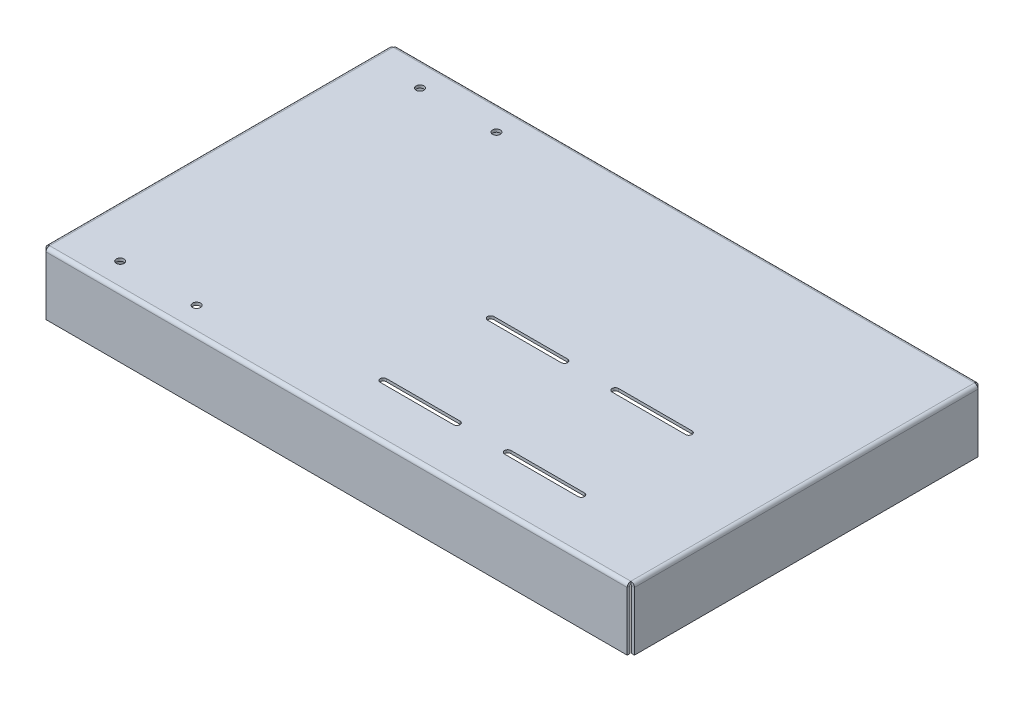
ISO-10303-21;
HEADER;
FILE_DESCRIPTION(('STEP AP214'),'2;1');
FILE_NAME('part.step','',(''),(''),'','','');
FILE_SCHEMA(('AUTOMOTIVE_DESIGN { 1 0 10303 214 1 1 1 1 }'));
ENDSEC;
DATA;
#1=APPLICATION_CONTEXT('core data for automotive mechanical design processes');
#2=APPLICATION_PROTOCOL_DEFINITION('international standard','automotive_design',2000,#1);
#3=PRODUCT_CONTEXT('',#1,'mechanical');
#4=PRODUCT('Part','Part','',(#3));
#5=PRODUCT_RELATED_PRODUCT_CATEGORY('part','',(#4));
#6=PRODUCT_DEFINITION_FORMATION('','',#4);
#7=PRODUCT_DEFINITION_CONTEXT('part definition',#1,'design');
#8=PRODUCT_DEFINITION('design','',#6,#7);
#9=PRODUCT_DEFINITION_SHAPE('','',#8);
#10=(LENGTH_UNIT() NAMED_UNIT(*) SI_UNIT(.MILLI.,.METRE.));
#11=(NAMED_UNIT(*) PLANE_ANGLE_UNIT() SI_UNIT($,.RADIAN.));
#12=(NAMED_UNIT(*) SI_UNIT($,.STERADIAN.) SOLID_ANGLE_UNIT());
#13=UNCERTAINTY_MEASURE_WITH_UNIT(LENGTH_MEASURE(1.E-05),#10,'distance_accuracy_value','');
#14=(GEOMETRIC_REPRESENTATION_CONTEXT(3) GLOBAL_UNCERTAINTY_ASSIGNED_CONTEXT((#13)) GLOBAL_UNIT_ASSIGNED_CONTEXT((#10,
#11,#12)) REPRESENTATION_CONTEXT('',''));
#15=CARTESIAN_POINT('',(0.,0.,0.));
#16=DIRECTION('',(0.,0.,1.));
#17=DIRECTION('',(1.,0.,0.));
#18=AXIS2_PLACEMENT_3D('',#15,#16,#17);
#19=CARTESIAN_POINT('',(-660.400000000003,-4.44089209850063E-13,393.7));
#20=DIRECTION('',(0.,0.999999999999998,0.));
#21=DIRECTION('',(0.,0.,1.));
#22=AXIS2_PLACEMENT_3D('',#19,#20,#21);
#23=PLANE('',#22);
#24=CARTESIAN_POINT('',(-371.475000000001,-3.33066907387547E-13,336.550000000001));
#25=DIRECTION('',(0.,0.999999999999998,0.));
#26=DIRECTION('',(0.,0.,1.));
#27=AXIS2_PLACEMENT_3D('',#24,#25,#26);
#28=CIRCLE('',#27,8.73125000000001);
#29=CARTESIAN_POINT('',(-371.475000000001,-3.3133218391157E-13,345.281250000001));
#30=VERTEX_POINT('',#29);
#31=EDGE_CURVE('E692',#30,#30,#28,.T.);
#32=ORIENTED_EDGE('',*,*,#31,.F.);
#33=EDGE_LOOP('',(#32));
#34=FACE_BOUND('',#33,.T.);
#35=CARTESIAN_POINT('',(-542.925000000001,-3.33066907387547E-13,336.550000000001));
#36=DIRECTION('',(0.,0.999999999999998,0.));
#37=DIRECTION('',(0.,0.,1.));
#38=AXIS2_PLACEMENT_3D('',#35,#36,#37);
#39=CIRCLE('',#38,8.73124999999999);
#40=CARTESIAN_POINT('',(-542.925000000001,-3.3133218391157E-13,345.281250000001));
#41=VERTEX_POINT('',#40);
#42=EDGE_CURVE('E696',#41,#41,#39,.T.);
#43=ORIENTED_EDGE('',*,*,#42,.F.);
#44=EDGE_LOOP('',(#43));
#45=FACE_BOUND('',#44,.T.);
#46=CARTESIAN_POINT('',(-371.475000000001,-2.22044604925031E-13,-336.55));
#47=DIRECTION('',(0.,0.999999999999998,0.));
#48=DIRECTION('',(0.,0.,1.));
#49=AXIS2_PLACEMENT_3D('',#46,#47,#48);
#50=CIRCLE('',#49,8.73125000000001);
#51=CARTESIAN_POINT('',(-371.475000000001,-2.20309881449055E-13,-327.81875));
#52=VERTEX_POINT('',#51);
#53=EDGE_CURVE('E700',#52,#52,#50,.T.);
#54=ORIENTED_EDGE('',*,*,#53,.F.);
#55=EDGE_LOOP('',(#54));
#56=FACE_BOUND('',#55,.T.);
#57=CARTESIAN_POINT('',(-542.925000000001,-2.22044604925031E-13,-336.55));
#58=DIRECTION('',(0.,0.999999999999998,0.));
#59=DIRECTION('',(0.,0.,1.));
#60=AXIS2_PLACEMENT_3D('',#57,#58,#59);
#61=CIRCLE('',#60,8.73124999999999);
#62=CARTESIAN_POINT('',(-542.925000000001,-2.20309881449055E-13,-327.81875));
#63=VERTEX_POINT('',#62);
#64=EDGE_CURVE('E273',#63,#63,#61,.T.);
#65=ORIENTED_EDGE('',*,*,#64,.F.);
#66=EDGE_LOOP('',(#65));
#67=FACE_BOUND('',#66,.T.);
#68=CARTESIAN_POINT('',(263.525,0.,273.050000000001));
#69=DIRECTION('',(0.,0.999999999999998,0.));
#70=DIRECTION('',(0.,0.,1.));
#71=AXIS2_PLACEMENT_3D('',#68,#69,#70);
#72=CIRCLE('',#71,7.14375);
#73=CARTESIAN_POINT('',(263.525,0.,265.906250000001));
#74=VERTEX_POINT('',#73);
#75=CARTESIAN_POINT('',(263.525,0.,280.193750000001));
#76=VERTEX_POINT('',#75);
#77=EDGE_CURVE('E32',#74,#76,#72,.T.);
#78=ORIENTED_EDGE('',*,*,#77,.F.);
#79=DIRECTION('',(-1.,0.,0.));
#80=VECTOR('',#79,1.);
#81=CARTESIAN_POINT('',(263.525,0.,265.906250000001));
#82=LINE('',#81,#80);
#83=CARTESIAN_POINT('',(428.625000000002,1.11022302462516E-13,265.906250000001));
#84=VERTEX_POINT('',#83);
#85=EDGE_CURVE('E267',#84,#74,#82,.T.);
#86=ORIENTED_EDGE('',*,*,#85,.F.);
#87=CARTESIAN_POINT('',(428.625000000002,1.11022302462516E-13,273.050000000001));
#88=DIRECTION('',(0.,0.999999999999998,0.));
#89=DIRECTION('',(0.,0.,1.));
#90=AXIS2_PLACEMENT_3D('',#87,#88,#89);
#91=CIRCLE('',#90,7.14375);
#92=CARTESIAN_POINT('',(428.625000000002,1.11022302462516E-13,280.193750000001));
#93=VERTEX_POINT('',#92);
#94=EDGE_CURVE('E270',#93,#84,#91,.T.);
#95=ORIENTED_EDGE('',*,*,#94,.F.);
#96=DIRECTION('',(1.,0.,0.));
#97=VECTOR('',#96,1.);
#98=CARTESIAN_POINT('',(263.525,0.,280.193750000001));
#99=LINE('',#98,#97);
#100=EDGE_CURVE('E279',#76,#93,#99,.T.);
#101=ORIENTED_EDGE('',*,*,#100,.F.);
#102=EDGE_LOOP('',(#78,#86,#95,#101));
#103=FACE_BOUND('',#102,.T.);
#104=CARTESIAN_POINT('',(-15.8749999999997,-1.11022302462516E-13,273.050000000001));
#105=DIRECTION('',(0.,0.999999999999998,0.));
#106=DIRECTION('',(0.,0.,1.));
#107=AXIS2_PLACEMENT_3D('',#104,#105,#106);
#108=CIRCLE('',#107,7.14375);
#109=CARTESIAN_POINT('',(-15.8749999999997,-1.11022302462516E-13,265.906250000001));
#110=VERTEX_POINT('',#109);
#111=CARTESIAN_POINT('',(-15.8749999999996,-1.11022302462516E-13,280.193750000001));
#112=VERTEX_POINT('',#111);
#113=EDGE_CURVE('E286',#110,#112,#108,.T.);
#114=ORIENTED_EDGE('',*,*,#113,.F.);
#115=DIRECTION('',(-1.,0.,0.));
#116=VECTOR('',#115,1.);
#117=CARTESIAN_POINT('',(-15.8749999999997,-1.11022302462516E-13,265.906250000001));
#118=LINE('',#117,#116);
#119=CARTESIAN_POINT('',(149.225,0.,265.906250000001));
#120=VERTEX_POINT('',#119);
#121=EDGE_CURVE('E294',#120,#110,#118,.T.);
#122=ORIENTED_EDGE('',*,*,#121,.F.);
#123=CARTESIAN_POINT('',(149.225,0.,273.050000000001));
#124=DIRECTION('',(0.,0.999999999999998,0.));
#125=DIRECTION('',(0.,0.,1.));
#126=AXIS2_PLACEMENT_3D('',#123,#124,#125);
#127=CIRCLE('',#126,7.14375);
#128=CARTESIAN_POINT('',(149.225,0.,280.193750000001));
#129=VERTEX_POINT('',#128);
#130=EDGE_CURVE('E308',#129,#120,#127,.T.);
#131=ORIENTED_EDGE('',*,*,#130,.F.);
#132=DIRECTION('',(1.,0.,0.));
#133=VECTOR('',#132,1.);
#134=CARTESIAN_POINT('',(-15.8749999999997,-1.11022302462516E-13,280.193750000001));
#135=LINE('',#134,#133);
#136=EDGE_CURVE('E305',#112,#129,#135,.T.);
#137=ORIENTED_EDGE('',*,*,#136,.F.);
#138=EDGE_LOOP('',(#114,#122,#131,#137));
#139=FACE_BOUND('',#138,.T.);
#140=CARTESIAN_POINT('',(263.525,1.11022302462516E-13,31.7500000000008));
#141=DIRECTION('',(0.,0.999999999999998,0.));
#142=DIRECTION('',(0.,0.,1.));
#143=AXIS2_PLACEMENT_3D('',#140,#141,#142);
#144=CIRCLE('',#143,7.14375);
#145=CARTESIAN_POINT('',(263.525,1.11022302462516E-13,24.6062500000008));
#146=VERTEX_POINT('',#145);
#147=CARTESIAN_POINT('',(263.525,1.11022302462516E-13,38.8937500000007));
#148=VERTEX_POINT('',#147);
#149=EDGE_CURVE('E315',#146,#148,#144,.T.);
#150=ORIENTED_EDGE('',*,*,#149,.F.);
#151=DIRECTION('',(-1.,0.,0.));
#152=VECTOR('',#151,1.);
#153=CARTESIAN_POINT('',(263.525,1.11022302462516E-13,24.6062500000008));
#154=LINE('',#153,#152);
#155=CARTESIAN_POINT('',(428.625000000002,2.22044604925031E-13,24.6062500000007));
#156=VERTEX_POINT('',#155);
#157=EDGE_CURVE('E326',#156,#146,#154,.T.);
#158=ORIENTED_EDGE('',*,*,#157,.F.);
#159=CARTESIAN_POINT('',(428.625000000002,2.22044604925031E-13,31.7500000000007));
#160=DIRECTION('',(0.,0.999999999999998,0.));
#161=DIRECTION('',(0.,0.,1.));
#162=AXIS2_PLACEMENT_3D('',#159,#160,#161);
#163=CIRCLE('',#162,7.14375);
#164=CARTESIAN_POINT('',(428.625000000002,2.22044604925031E-13,38.8937500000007));
#165=VERTEX_POINT('',#164);
#166=EDGE_CURVE('E340',#165,#156,#163,.T.);
#167=ORIENTED_EDGE('',*,*,#166,.F.);
#168=DIRECTION('',(1.,0.,0.));
#169=VECTOR('',#168,1.);
#170=CARTESIAN_POINT('',(263.525,1.11022302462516E-13,38.8937500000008));
#171=LINE('',#170,#169);
#172=EDGE_CURVE('E337',#148,#165,#171,.T.);
#173=ORIENTED_EDGE('',*,*,#172,.F.);
#174=EDGE_LOOP('',(#150,#158,#167,#173));
#175=FACE_BOUND('',#174,.T.);
#176=CARTESIAN_POINT('',(-15.8749999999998,0.,31.7500000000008));
#177=DIRECTION('',(0.,0.999999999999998,0.));
#178=DIRECTION('',(0.,0.,1.));
#179=AXIS2_PLACEMENT_3D('',#176,#177,#178);
#180=CIRCLE('',#179,7.14375);
#181=CARTESIAN_POINT('',(-15.8749999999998,0.,24.6062500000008));
#182=VERTEX_POINT('',#181);
#183=CARTESIAN_POINT('',(-15.8749999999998,0.,38.8937500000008));
#184=VERTEX_POINT('',#183);
#185=EDGE_CURVE('E347',#182,#184,#180,.T.);
#186=ORIENTED_EDGE('',*,*,#185,.F.);
#187=DIRECTION('',(-1.,0.,0.));
#188=VECTOR('',#187,1.);
#189=CARTESIAN_POINT('',(-15.8749999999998,0.,24.6062500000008));
#190=LINE('',#189,#188);
#191=CARTESIAN_POINT('',(149.225,1.11022302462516E-13,24.6062500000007));
#192=VERTEX_POINT('',#191);
#193=EDGE_CURVE('E358',#192,#182,#190,.T.);
#194=ORIENTED_EDGE('',*,*,#193,.F.);
#195=CARTESIAN_POINT('',(149.225,1.11022302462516E-13,31.7500000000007));
#196=DIRECTION('',(0.,0.999999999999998,0.));
#197=DIRECTION('',(0.,0.,1.));
#198=AXIS2_PLACEMENT_3D('',#195,#196,#197);
#199=CIRCLE('',#198,7.14375);
#200=CARTESIAN_POINT('',(149.225,1.11022302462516E-13,38.8937500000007));
#201=VERTEX_POINT('',#200);
#202=EDGE_CURVE('E372',#201,#192,#199,.T.);
#203=ORIENTED_EDGE('',*,*,#202,.F.);
#204=DIRECTION('',(1.,0.,0.));
#205=VECTOR('',#204,1.);
#206=CARTESIAN_POINT('',(-15.8749999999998,0.,38.8937500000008));
#207=LINE('',#206,#205);
#208=EDGE_CURVE('E369',#184,#201,#207,.T.);
#209=ORIENTED_EDGE('',*,*,#208,.F.);
#210=EDGE_LOOP('',(#186,#194,#203,#209));
#211=FACE_BOUND('',#210,.T.);
#212=DIRECTION('',(1.,0.,0.));
#213=VECTOR('',#212,1.);
#214=CARTESIAN_POINT('',(-660.400000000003,-4.44089209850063E-13,385.572));
#215=LINE('',#214,#213);
#216=CARTESIAN_POINT('',(-652.272000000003,-4.44089209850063E-13,385.572));
#217=VERTEX_POINT('',#216);
#218=CARTESIAN_POINT('',(652.272000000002,2.22044604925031E-13,385.572));
#219=VERTEX_POINT('',#218);
#220=EDGE_CURVE('E474',#217,#219,#215,.T.);
#221=ORIENTED_EDGE('',*,*,#220,.T.);
#222=DIRECTION('',(0.,0.,-1.));
#223=VECTOR('',#222,1.);
#224=CARTESIAN_POINT('',(652.272000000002,2.22044604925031E-13,393.7));
#225=LINE('',#224,#223);
#226=CARTESIAN_POINT('',(652.272000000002,4.44089209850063E-13,-385.572));
#227=VERTEX_POINT('',#226);
#228=EDGE_CURVE('E397',#219,#227,#225,.T.);
#229=ORIENTED_EDGE('',*,*,#228,.T.);
#230=DIRECTION('',(-1.,0.,0.));
#231=VECTOR('',#230,1.);
#232=CARTESIAN_POINT('',(7264.40000000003,3.44169137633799E-12,-385.572000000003));
#233=LINE('',#232,#231);
#234=CARTESIAN_POINT('',(-652.272000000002,-2.22044604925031E-13,-385.572));
#235=VERTEX_POINT('',#234);
#236=EDGE_CURVE('E513',#227,#235,#233,.T.);
#237=ORIENTED_EDGE('',*,*,#236,.T.);
#238=DIRECTION('',(0.,0.,1.));
#239=VECTOR('',#238,1.);
#240=CARTESIAN_POINT('',(-652.272000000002,-2.22044604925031E-13,-393.7));
#241=LINE('',#240,#239);
#242=EDGE_CURVE('E526',#235,#217,#241,.T.);
#243=ORIENTED_EDGE('',*,*,#242,.T.);
#244=EDGE_LOOP('',(#221,#229,#237,#243));
#245=FACE_BOUND('',#244,.T.);
#246=ADVANCED_FACE('F17',(#34,#45,#56,#67,#103,#139,#175,#211,#245),#23,.T.);
#247=CARTESIAN_POINT('',(-660.400000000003,-6.35000000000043,393.7));
#248=DIRECTION('',(0.,0.999999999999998,0.));
#249=DIRECTION('',(0.,0.,1.));
#250=AXIS2_PLACEMENT_3D('',#247,#248,#249);
#251=PLANE('',#250);
#252=CARTESIAN_POINT('',(-371.475000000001,-6.35000000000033,336.550000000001));
#253=DIRECTION('',(0.,0.999999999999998,0.));
#254=DIRECTION('',(0.,0.,1.));
#255=AXIS2_PLACEMENT_3D('',#252,#253,#254);
#256=CIRCLE('',#255,8.73125000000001);
#257=CARTESIAN_POINT('',(-371.475000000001,-6.35000000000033,345.281250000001));
#258=VERTEX_POINT('',#257);
#259=EDGE_CURVE('E1284',#258,#258,#256,.T.);
#260=ORIENTED_EDGE('',*,*,#259,.T.);
#261=EDGE_LOOP('',(#260));
#262=FACE_BOUND('',#261,.T.);
#263=CARTESIAN_POINT('',(-542.925000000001,-6.35000000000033,336.550000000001));
#264=DIRECTION('',(0.,0.999999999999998,0.));
#265=DIRECTION('',(0.,0.,1.));
#266=AXIS2_PLACEMENT_3D('',#263,#264,#265);
#267=CIRCLE('',#266,8.73124999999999);
#268=CARTESIAN_POINT('',(-542.925000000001,-6.35000000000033,345.281250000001));
#269=VERTEX_POINT('',#268);
#270=EDGE_CURVE('E1288',#269,#269,#267,.T.);
#271=ORIENTED_EDGE('',*,*,#270,.T.);
#272=EDGE_LOOP('',(#271));
#273=FACE_BOUND('',#272,.T.);
#274=CARTESIAN_POINT('',(-371.475000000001,-6.35000000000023,-336.55));
#275=DIRECTION('',(0.,0.999999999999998,0.));
#276=DIRECTION('',(0.,0.,1.));
#277=AXIS2_PLACEMENT_3D('',#274,#275,#276);
#278=CIRCLE('',#277,8.73125000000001);
#279=CARTESIAN_POINT('',(-371.475000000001,-6.35000000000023,-327.81875));
#280=VERTEX_POINT('',#279);
#281=EDGE_CURVE('E1292',#280,#280,#278,.T.);
#282=ORIENTED_EDGE('',*,*,#281,.T.);
#283=EDGE_LOOP('',(#282));
#284=FACE_BOUND('',#283,.T.);
#285=CARTESIAN_POINT('',(-542.925000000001,-6.35000000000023,-336.55));
#286=DIRECTION('',(0.,0.999999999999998,0.));
#287=DIRECTION('',(0.,0.,1.));
#288=AXIS2_PLACEMENT_3D('',#285,#286,#287);
#289=CIRCLE('',#288,8.73124999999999);
#290=CARTESIAN_POINT('',(-542.925000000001,-6.35000000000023,-327.81875));
#291=VERTEX_POINT('',#290);
#292=EDGE_CURVE('E280',#291,#291,#289,.T.);
#293=ORIENTED_EDGE('',*,*,#292,.T.);
#294=EDGE_LOOP('',(#293));
#295=FACE_BOUND('',#294,.T.);
#296=DIRECTION('',(-1.,0.,0.));
#297=VECTOR('',#296,1.);
#298=CARTESIAN_POINT('',(263.525,-6.34999999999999,265.906250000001));
#299=LINE('',#298,#297);
#300=CARTESIAN_POINT('',(428.625000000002,-6.34999999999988,265.906250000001));
#301=VERTEX_POINT('',#300);
#302=CARTESIAN_POINT('',(263.525,-6.34999999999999,265.906250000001));
#303=VERTEX_POINT('',#302);
#304=EDGE_CURVE('E257',#301,#303,#299,.T.);
#305=ORIENTED_EDGE('',*,*,#304,.T.);
#306=CARTESIAN_POINT('',(263.525,-6.34999999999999,273.050000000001));
#307=DIRECTION('',(0.,0.999999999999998,0.));
#308=DIRECTION('',(0.,0.,1.));
#309=AXIS2_PLACEMENT_3D('',#306,#307,#308);
#310=CIRCLE('',#309,7.14375);
#311=CARTESIAN_POINT('',(263.525,-6.34999999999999,280.193750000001));
#312=VERTEX_POINT('',#311);
#313=EDGE_CURVE('E251',#303,#312,#310,.T.);
#314=ORIENTED_EDGE('',*,*,#313,.T.);
#315=DIRECTION('',(1.,0.,0.));
#316=VECTOR('',#315,1.);
#317=CARTESIAN_POINT('',(263.525,-6.34999999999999,280.193750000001));
#318=LINE('',#317,#316);
#319=CARTESIAN_POINT('',(428.625000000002,-6.34999999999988,280.193750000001));
#320=VERTEX_POINT('',#319);
#321=EDGE_CURVE('E260',#312,#320,#318,.T.);
#322=ORIENTED_EDGE('',*,*,#321,.T.);
#323=CARTESIAN_POINT('',(428.625000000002,-6.34999999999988,273.050000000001));
#324=DIRECTION('',(0.,0.999999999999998,0.));
#325=DIRECTION('',(0.,0.,1.));
#326=AXIS2_PLACEMENT_3D('',#323,#324,#325);
#327=CIRCLE('',#326,7.14375);
#328=EDGE_CURVE('E40',#320,#301,#327,.T.);
#329=ORIENTED_EDGE('',*,*,#328,.T.);
#330=EDGE_LOOP('',(#305,#314,#322,#329));
#331=FACE_BOUND('',#330,.T.);
#332=DIRECTION('',(-1.,0.,0.));
#333=VECTOR('',#332,1.);
#334=CARTESIAN_POINT('',(-15.8749999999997,-6.35000000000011,265.906250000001));
#335=LINE('',#334,#333);
#336=CARTESIAN_POINT('',(149.225,-6.34999999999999,265.906250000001));
#337=VERTEX_POINT('',#336);
#338=CARTESIAN_POINT('',(-15.8749999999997,-6.35000000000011,265.906250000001));
#339=VERTEX_POINT('',#338);
#340=EDGE_CURVE('E300',#337,#339,#335,.T.);
#341=ORIENTED_EDGE('',*,*,#340,.T.);
#342=CARTESIAN_POINT('',(-15.8749999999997,-6.35000000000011,273.050000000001));
#343=DIRECTION('',(0.,0.999999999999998,0.));
#344=DIRECTION('',(0.,0.,1.));
#345=AXIS2_PLACEMENT_3D('',#342,#343,#344);
#346=CIRCLE('',#345,7.14375);
#347=CARTESIAN_POINT('',(-15.8749999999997,-6.35000000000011,280.193750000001));
#348=VERTEX_POINT('',#347);
#349=EDGE_CURVE('E290',#339,#348,#346,.T.);
#350=ORIENTED_EDGE('',*,*,#349,.T.);
#351=DIRECTION('',(1.,0.,0.));
#352=VECTOR('',#351,1.);
#353=CARTESIAN_POINT('',(-15.8749999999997,-6.35000000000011,280.193750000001));
#354=LINE('',#353,#352);
#355=CARTESIAN_POINT('',(149.225,-6.34999999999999,280.193750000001));
#356=VERTEX_POINT('',#355);
#357=EDGE_CURVE('E293',#348,#356,#354,.T.);
#358=ORIENTED_EDGE('',*,*,#357,.T.);
#359=CARTESIAN_POINT('',(149.225,-6.34999999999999,273.050000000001));
#360=DIRECTION('',(0.,0.999999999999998,0.));
#361=DIRECTION('',(0.,0.,1.));
#362=AXIS2_PLACEMENT_3D('',#359,#360,#361);
#363=CIRCLE('',#362,7.14375);
#364=EDGE_CURVE('E297',#356,#337,#363,.T.);
#365=ORIENTED_EDGE('',*,*,#364,.T.);
#366=EDGE_LOOP('',(#341,#350,#358,#365));
#367=FACE_BOUND('',#366,.T.);
#368=DIRECTION('',(-1.,0.,0.));
#369=VECTOR('',#368,1.);
#370=CARTESIAN_POINT('',(263.525,-6.34999999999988,24.6062500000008));
#371=LINE('',#370,#369);
#372=CARTESIAN_POINT('',(428.625000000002,-6.34999999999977,24.6062500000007));
#373=VERTEX_POINT('',#372);
#374=CARTESIAN_POINT('',(263.525,-6.34999999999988,24.6062500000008));
#375=VERTEX_POINT('',#374);
#376=EDGE_CURVE('E332',#373,#375,#371,.T.);
#377=ORIENTED_EDGE('',*,*,#376,.T.);
#378=CARTESIAN_POINT('',(263.525,-6.34999999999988,31.7500000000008));
#379=DIRECTION('',(0.,0.999999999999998,0.));
#380=DIRECTION('',(0.,0.,1.));
#381=AXIS2_PLACEMENT_3D('',#378,#379,#380);
#382=CIRCLE('',#381,7.14375);
#383=CARTESIAN_POINT('',(263.525,-6.34999999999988,38.8937500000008));
#384=VERTEX_POINT('',#383);
#385=EDGE_CURVE('E322',#375,#384,#382,.T.);
#386=ORIENTED_EDGE('',*,*,#385,.T.);
#387=DIRECTION('',(1.,0.,0.));
#388=VECTOR('',#387,1.);
#389=CARTESIAN_POINT('',(263.525,-6.34999999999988,38.8937500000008));
#390=LINE('',#389,#388);
#391=CARTESIAN_POINT('',(428.625000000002,-6.34999999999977,38.8937500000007));
#392=VERTEX_POINT('',#391);
#393=EDGE_CURVE('E325',#384,#392,#390,.T.);
#394=ORIENTED_EDGE('',*,*,#393,.T.);
#395=CARTESIAN_POINT('',(428.625000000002,-6.34999999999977,31.7500000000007));
#396=DIRECTION('',(0.,0.999999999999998,0.));
#397=DIRECTION('',(0.,0.,1.));
#398=AXIS2_PLACEMENT_3D('',#395,#396,#397);
#399=CIRCLE('',#398,7.14375);
#400=EDGE_CURVE('E329',#392,#373,#399,.T.);
#401=ORIENTED_EDGE('',*,*,#400,.T.);
#402=EDGE_LOOP('',(#377,#386,#394,#401));
#403=FACE_BOUND('',#402,.T.);
#404=DIRECTION('',(-1.,0.,0.));
#405=VECTOR('',#404,1.);
#406=CARTESIAN_POINT('',(-15.8749999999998,-6.34999999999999,24.6062500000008));
#407=LINE('',#406,#405);
#408=CARTESIAN_POINT('',(149.225,-6.34999999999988,24.6062500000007));
#409=VERTEX_POINT('',#408);
#410=CARTESIAN_POINT('',(-15.8749999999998,-6.34999999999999,24.6062500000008));
#411=VERTEX_POINT('',#410);
#412=EDGE_CURVE('E364',#409,#411,#407,.T.);
#413=ORIENTED_EDGE('',*,*,#412,.T.);
#414=CARTESIAN_POINT('',(-15.8749999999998,-6.34999999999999,31.7500000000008));
#415=DIRECTION('',(0.,0.999999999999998,0.));
#416=DIRECTION('',(0.,0.,1.));
#417=AXIS2_PLACEMENT_3D('',#414,#415,#416);
#418=CIRCLE('',#417,7.14375);
#419=CARTESIAN_POINT('',(-15.8749999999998,-6.34999999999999,38.8937500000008));
#420=VERTEX_POINT('',#419);
#421=EDGE_CURVE('E354',#411,#420,#418,.T.);
#422=ORIENTED_EDGE('',*,*,#421,.T.);
#423=DIRECTION('',(1.,0.,0.));
#424=VECTOR('',#423,1.);
#425=CARTESIAN_POINT('',(-15.8749999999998,-6.34999999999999,38.8937500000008));
#426=LINE('',#425,#424);
#427=CARTESIAN_POINT('',(149.225,-6.34999999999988,38.8937500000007));
#428=VERTEX_POINT('',#427);
#429=EDGE_CURVE('E357',#420,#428,#426,.T.);
#430=ORIENTED_EDGE('',*,*,#429,.T.);
#431=CARTESIAN_POINT('',(149.225,-6.34999999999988,31.7500000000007));
#432=DIRECTION('',(0.,0.999999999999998,0.));
#433=DIRECTION('',(0.,0.,1.));
#434=AXIS2_PLACEMENT_3D('',#431,#432,#433);
#435=CIRCLE('',#434,7.14375);
#436=EDGE_CURVE('E361',#428,#409,#435,.T.);
#437=ORIENTED_EDGE('',*,*,#436,.T.);
#438=EDGE_LOOP('',(#413,#422,#430,#437));
#439=FACE_BOUND('',#438,.T.);
#440=DIRECTION('',(0.,0.,-1.));
#441=VECTOR('',#440,1.);
#442=CARTESIAN_POINT('',(652.272000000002,-6.34999999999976,393.7));
#443=LINE('',#442,#441);
#444=CARTESIAN_POINT('',(652.272000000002,-6.34999999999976,385.572));
#445=VERTEX_POINT('',#444);
#446=CARTESIAN_POINT('',(652.272000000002,-6.34999999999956,-385.572));
#447=VERTEX_POINT('',#446);
#448=EDGE_CURVE('E386',#445,#447,#443,.T.);
#449=ORIENTED_EDGE('',*,*,#448,.F.);
#450=DIRECTION('',(1.,0.,0.));
#451=VECTOR('',#450,1.);
#452=CARTESIAN_POINT('',(-660.400000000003,-6.35000000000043,385.572));
#453=LINE('',#452,#451);
#454=CARTESIAN_POINT('',(-652.272000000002,-6.35000000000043,385.572));
#455=VERTEX_POINT('',#454);
#456=EDGE_CURVE('E438',#455,#445,#453,.T.);
#457=ORIENTED_EDGE('',*,*,#456,.F.);
#458=DIRECTION('',(0.,0.,1.));
#459=VECTOR('',#458,1.);
#460=CARTESIAN_POINT('',(-652.272000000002,-6.35000000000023,-393.7));
#461=LINE('',#460,#459);
#462=CARTESIAN_POINT('',(-652.272000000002,-6.35000000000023,-385.572));
#463=VERTEX_POINT('',#462);
#464=EDGE_CURVE('E490',#463,#455,#461,.T.);
#465=ORIENTED_EDGE('',*,*,#464,.F.);
#466=DIRECTION('',(-1.,0.,0.));
#467=VECTOR('',#466,1.);
#468=CARTESIAN_POINT('',(7264.40000000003,-6.34999999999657,-385.572000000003));
#469=LINE('',#468,#467);
#470=EDGE_CURVE('E539',#447,#463,#469,.T.);
#471=ORIENTED_EDGE('',*,*,#470,.F.);
#472=EDGE_LOOP('',(#449,#457,#465,#471));
#473=FACE_BOUND('',#472,.T.);
#474=ADVANCED_FACE('F264',(#262,#273,#284,#295,#331,#367,#403,#439,#473),#251,.F.);
#475=CARTESIAN_POINT('',(7264.40000000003,-139.699999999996,-393.700000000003));
#476=DIRECTION('',(0.,-0.999999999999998,0.));
#477=DIRECTION('',(1.,0.,0.));
#478=AXIS2_PLACEMENT_3D('',#475,#476,#477);
#479=PLANE('',#478);
#480=DIRECTION('',(0.,0.,1.));
#481=VECTOR('',#480,1.);
#482=CARTESIAN_POINT('',(-652.253948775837,-139.7,-393.7));
#483=LINE('',#482,#481);
#484=CARTESIAN_POINT('',(-652.253948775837,-139.7,-393.7));
#485=VERTEX_POINT('',#484);
#486=CARTESIAN_POINT('',(-652.253948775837,-139.7,-387.35));
#487=VERTEX_POINT('',#486);
#488=EDGE_CURVE('E11',#485,#487,#483,.T.);
#489=ORIENTED_EDGE('',*,*,#488,.F.);
#490=DIRECTION('',(1.,0.,0.));
#491=VECTOR('',#490,1.);
#492=CARTESIAN_POINT('',(7264.40000000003,-139.699999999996,-393.700000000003));
#493=LINE('',#492,#491);
#494=CARTESIAN_POINT('',(652.253948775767,-139.7,-393.7));
#495=VERTEX_POINT('',#494);
#496=EDGE_CURVE('E559',#495,#485,#493,.F.);
#497=ORIENTED_EDGE('',*,*,#496,.F.);
#498=DIRECTION('',(0.,0.,1.));
#499=VECTOR('',#498,1.);
#500=CARTESIAN_POINT('',(652.253948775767,-139.7,-393.7));
#501=LINE('',#500,#499);
#502=CARTESIAN_POINT('',(652.253948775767,-139.7,-387.35));
#503=VERTEX_POINT('',#502);
#504=EDGE_CURVE('E25',#495,#503,#501,.T.);
#505=ORIENTED_EDGE('',*,*,#504,.T.);
#506=DIRECTION('',(1.,0.,0.));
#507=VECTOR('',#506,1.);
#508=CARTESIAN_POINT('',(7264.40000000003,-139.699999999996,-387.350000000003));
#509=LINE('',#508,#507);
#510=EDGE_CURVE('E565',#503,#487,#509,.F.);
#511=ORIENTED_EDGE('',*,*,#510,.T.);
#512=EDGE_LOOP('',(#489,#497,#505,#511));
#513=FACE_BOUND('',#512,.T.);
#514=ADVANCED_FACE('F589',(#513),#479,.T.);
#515=CARTESIAN_POINT('',(652.253948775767,-139.7,-393.7));
#516=DIRECTION('',(1.,0.,0.));
#517=DIRECTION('',(0.,0.999999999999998,0.));
#518=AXIS2_PLACEMENT_3D('',#515,#516,#517);
#519=PLANE('',#518);
#520=ORIENTED_EDGE('',*,*,#504,.F.);
#521=DIRECTION('',(0.,0.999999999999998,0.));
#522=VECTOR('',#521,1.);
#523=CARTESIAN_POINT('',(652.253948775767,-139.7,-393.7));
#524=LINE('',#523,#522);
#525=CARTESIAN_POINT('',(652.253948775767,-8.12799999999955,-393.7));
#526=VERTEX_POINT('',#525);
#527=EDGE_CURVE('E577',#495,#526,#524,.T.);
#528=ORIENTED_EDGE('',*,*,#527,.T.);
#529=DIRECTION('',(0.,0.,1.));
#530=VECTOR('',#529,1.);
#531=CARTESIAN_POINT('',(652.253948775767,-8.12799999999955,-393.7));
#532=LINE('',#531,#530);
#533=CARTESIAN_POINT('',(652.253948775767,-8.12799999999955,-387.35));
#534=VERTEX_POINT('',#533);
#535=EDGE_CURVE('E584',#526,#534,#532,.T.);
#536=ORIENTED_EDGE('',*,*,#535,.T.);
#537=DIRECTION('',(0.,0.999999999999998,0.));
#538=VECTOR('',#537,1.);
#539=CARTESIAN_POINT('',(652.253948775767,-139.7,-387.35));
#540=LINE('',#539,#538);
#541=EDGE_CURVE('E564',#503,#534,#540,.T.);
#542=ORIENTED_EDGE('',*,*,#541,.F.);
#543=EDGE_LOOP('',(#520,#528,#536,#542));
#544=FACE_BOUND('',#543,.T.);
#545=ADVANCED_FACE('F597',(#544),#519,.T.);
#546=CARTESIAN_POINT('',(-652.253948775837,-139.7,-393.7));
#547=DIRECTION('',(1.,0.,0.));
#548=DIRECTION('',(0.,0.999999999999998,0.));
#549=AXIS2_PLACEMENT_3D('',#546,#547,#548);
#550=PLANE('',#549);
#551=DIRECTION('',(0.,0.999999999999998,0.));
#552=VECTOR('',#551,1.);
#553=CARTESIAN_POINT('',(-652.253948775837,-139.7,-393.7));
#554=LINE('',#553,#552);
#555=CARTESIAN_POINT('',(-652.253948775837,-8.12800000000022,-393.7));
#556=VERTEX_POINT('',#555);
#557=EDGE_CURVE('E571',#556,#485,#554,.F.);
#558=ORIENTED_EDGE('',*,*,#557,.T.);
#559=ORIENTED_EDGE('',*,*,#488,.T.);
#560=DIRECTION('',(0.,0.999999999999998,0.));
#561=VECTOR('',#560,1.);
#562=CARTESIAN_POINT('',(-652.253948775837,-139.7,-387.35));
#563=LINE('',#562,#561);
#564=CARTESIAN_POINT('',(-652.253948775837,-8.12800000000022,-387.35));
#565=VERTEX_POINT('',#564);
#566=EDGE_CURVE('E568',#565,#487,#563,.F.);
#567=ORIENTED_EDGE('',*,*,#566,.F.);
#568=DIRECTION('',(0.,0.,1.));
#569=VECTOR('',#568,1.);
#570=CARTESIAN_POINT('',(-652.253948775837,-8.12800000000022,-393.7));
#571=LINE('',#570,#569);
#572=EDGE_CURVE('E20',#556,#565,#571,.T.);
#573=ORIENTED_EDGE('',*,*,#572,.F.);
#574=EDGE_LOOP('',(#558,#559,#567,#573));
#575=FACE_BOUND('',#574,.T.);
#576=ADVANCED_FACE('F892',(#575),#550,.F.);
#577=CARTESIAN_POINT('',(7264.40000000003,-139.699999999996,-387.350000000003));
#578=DIRECTION('',(0.,0.,1.));
#579=DIRECTION('',(1.,0.,0.));
#580=AXIS2_PLACEMENT_3D('',#577,#578,#579);
#581=PLANE('',#580);
#582=DIRECTION('',(1.,0.,0.));
#583=VECTOR('',#582,1.);
#584=CARTESIAN_POINT('',(7264.40000000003,-8.12799999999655,-387.350000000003));
#585=LINE('',#584,#583);
#586=EDGE_CURVE('E562',#534,#565,#585,.F.);
#587=ORIENTED_EDGE('',*,*,#586,.T.);
#588=ORIENTED_EDGE('',*,*,#566,.T.);
#589=ORIENTED_EDGE('',*,*,#510,.F.);
#590=ORIENTED_EDGE('',*,*,#541,.T.);
#591=EDGE_LOOP('',(#587,#588,#589,#590));
#592=FACE_BOUND('',#591,.T.);
#593=ADVANCED_FACE('F594',(#592),#581,.T.);
#594=CARTESIAN_POINT('',(7264.40000000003,-139.699999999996,-393.700000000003));
#595=DIRECTION('',(0.,0.,1.));
#596=DIRECTION('',(1.,0.,0.));
#597=AXIS2_PLACEMENT_3D('',#594,#595,#596);
#598=PLANE('',#597);
#599=DIRECTION('',(1.,0.,0.));
#600=VECTOR('',#599,1.);
#601=CARTESIAN_POINT('',(7264.40000000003,-8.12799999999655,-393.700000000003));
#602=LINE('',#601,#600);
#603=EDGE_CURVE('E574',#526,#556,#602,.F.);
#604=ORIENTED_EDGE('',*,*,#603,.F.);
#605=ORIENTED_EDGE('',*,*,#527,.F.);
#606=ORIENTED_EDGE('',*,*,#496,.T.);
#607=ORIENTED_EDGE('',*,*,#557,.F.);
#608=EDGE_LOOP('',(#604,#605,#606,#607));
#609=FACE_BOUND('',#608,.T.);
#610=ADVANCED_FACE('F875',(#609),#598,.F.);
#611=CARTESIAN_POINT('',(652.253948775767,-8.12799999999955,-387.35));
#612=CARTESIAN_POINT('',(652.253948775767,-8.12799999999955,-389.466666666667));
#613=CARTESIAN_POINT('',(652.253948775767,-8.12799999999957,-391.583333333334));
#614=CARTESIAN_POINT('',(652.253948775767,-8.12799999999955,-393.7));
#615=CARTESIAN_POINT('',(652.253948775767,-4.57199999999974,-387.35));
#616=CARTESIAN_POINT('',(652.253948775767,-0.338666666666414,-389.466666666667));
#617=CARTESIAN_POINT('',(652.253948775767,3.89466666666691,-391.583333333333));
#618=CARTESIAN_POINT('',(652.253948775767,8.12800000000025,-393.7));
#619=CARTESIAN_POINT('',(652.290051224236,-4.57199999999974,-383.794));
#620=CARTESIAN_POINT('',(652.290051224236,-0.338666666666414,-381.677333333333));
#621=CARTESIAN_POINT('',(652.290051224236,3.89466666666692,-379.560666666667));
#622=CARTESIAN_POINT('',(652.290051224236,8.12800000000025,-377.444));
#623=CARTESIAN_POINT('',(652.290051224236,-8.12799999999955,-383.794));
#624=CARTESIAN_POINT('',(652.290051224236,-8.12799999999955,-381.677333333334));
#625=CARTESIAN_POINT('',(652.290051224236,-8.12799999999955,-379.560666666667));
#626=CARTESIAN_POINT('',(652.290051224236,-8.12799999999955,-377.444));
#627=CARTESIAN_POINT('',(652.290051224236,-11.6839999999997,-383.794));
#628=CARTESIAN_POINT('',(652.290051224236,-15.9173333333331,-381.677333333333));
#629=CARTESIAN_POINT('',(652.290051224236,-20.1506666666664,-379.560666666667));
#630=CARTESIAN_POINT('',(652.290051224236,-24.3839999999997,-377.444));
#631=CARTESIAN_POINT('',(652.253948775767,-11.6839999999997,-387.35));
#632=CARTESIAN_POINT('',(652.253948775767,-15.9173333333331,-389.466666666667));
#633=CARTESIAN_POINT('',(652.253948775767,-20.1506666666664,-391.583333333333));
#634=CARTESIAN_POINT('',(652.253948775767,-24.3839999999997,-393.7));
#635=CARTESIAN_POINT('',(652.253948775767,-8.12799999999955,-387.35));
#636=CARTESIAN_POINT('',(652.253948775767,-8.12799999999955,-389.466666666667));
#637=CARTESIAN_POINT('',(652.253948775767,-8.12799999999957,-391.583333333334));
#638=CARTESIAN_POINT('',(652.253948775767,-8.12799999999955,-393.7));
#639=(BOUNDED_SURFACE() B_SPLINE_SURFACE(3,3,((#611,#612,#613,#614),(#615,#616,#617,#618),(#619,
#620,#621,#622),(#623,#624,#625,#626),(#627,#628,#629,#630),(#631,#632,#633,#634),(#635,#636,
#637,#638)),.UNSPECIFIED.,.T.,.F.,.F.) B_SPLINE_SURFACE_WITH_KNOTS((4,3,4),(4,4),(0.,0.5,1.),
(0.,1.),.UNSPECIFIED.) GEOMETRIC_REPRESENTATION_ITEM() RATIONAL_B_SPLINE_SURFACE(((1.,1.,1.,1.),
(0.333333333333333,0.333333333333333,0.333333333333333,0.333333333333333),(0.333333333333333,
0.333333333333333,0.333333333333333,0.333333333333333),(1.,1.,1.,1.),(0.333333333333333,
0.333333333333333,0.333333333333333,0.333333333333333),(0.333333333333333,0.333333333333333,
0.333333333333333,0.333333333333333),(1.,1.,1.,1.))) REPRESENTATION_ITEM('') SURFACE());
#640=CARTESIAN_POINT('',(652.272000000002,-8.12799999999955,-385.572));
#641=DIRECTION('',(0.999997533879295,0.,-0.00222086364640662));
#642=DIRECTION('',(-0.00222086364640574,0.,-0.999997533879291));
#643=AXIS2_PLACEMENT_3D('',#640,#641,#642);
#644=ELLIPSE('',#643,8.12802004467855,8.128);
#645=EDGE_CURVE('E551',#526,#227,#644,.T.);
#646=DIRECTION('',(0.,-0.999999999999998,0.));
#647=VECTOR('',#646,1.);
#648=CARTESIAN_POINT('',(652.272000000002,4.44089209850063E-13,-385.572));
#649=LINE('',#648,#647);
#650=EDGE_CURVE('E556',#227,#447,#649,.T.);
#651=CARTESIAN_POINT('',(652.272000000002,-8.12799999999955,-385.572));
#652=DIRECTION('',(0.999948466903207,0.,-0.010152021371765));
#653=DIRECTION('',(-0.0101520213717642,0.,-0.999948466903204));
#654=AXIS2_PLACEMENT_3D('',#651,#652,#653);
#655=ELLIPSE('',#654,1.77809163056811,1.778);
#656=EDGE_CURVE('E542',#534,#447,#655,.T.);
#657=ORIENTED_EDGE('',*,*,#535,.F.);
#658=ORIENTED_EDGE('',*,*,#645,.T.);
#659=ORIENTED_EDGE('',*,*,#650,.T.);
#660=ORIENTED_EDGE('',*,*,#656,.F.);
#661=EDGE_LOOP('',(#657,#658,#659,#660));
#662=FACE_BOUND('',#661,.T.);
#663=ADVANCED_FACE('F602',(#662),#639,.F.);
#664=CARTESIAN_POINT('',(-652.290051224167,-8.12800000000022,-383.794));
#665=CARTESIAN_POINT('',(-652.290051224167,-8.12800000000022,-381.677333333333));
#666=CARTESIAN_POINT('',(-652.290051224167,-8.12800000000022,-379.560666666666));
#667=CARTESIAN_POINT('',(-652.290051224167,-8.12800000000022,-377.444));
#668=CARTESIAN_POINT('',(-652.290051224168,-4.57200000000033,-383.794));
#669=CARTESIAN_POINT('',(-652.290051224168,-0.338666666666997,-381.677333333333));
#670=CARTESIAN_POINT('',(-652.290051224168,3.89466666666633,-379.560666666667));
#671=CARTESIAN_POINT('',(-652.290051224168,8.12799999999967,-377.444));
#672=CARTESIAN_POINT('',(-652.253948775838,-4.57200000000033,-387.35));
#673=CARTESIAN_POINT('',(-652.253948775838,-0.338666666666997,-389.466666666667));
#674=CARTESIAN_POINT('',(-652.253948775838,3.89466666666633,-391.583333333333));
#675=CARTESIAN_POINT('',(-652.253948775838,8.12799999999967,-393.7));
#676=CARTESIAN_POINT('',(-652.253948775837,-8.12800000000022,-387.35));
#677=CARTESIAN_POINT('',(-652.253948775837,-8.12800000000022,-389.466666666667));
#678=CARTESIAN_POINT('',(-652.253948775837,-8.12800000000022,-391.583333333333));
#679=CARTESIAN_POINT('',(-652.253948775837,-8.12800000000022,-393.7));
#680=CARTESIAN_POINT('',(-652.253948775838,-11.6840000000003,-387.35));
#681=CARTESIAN_POINT('',(-652.253948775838,-15.9173333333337,-389.466666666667));
#682=CARTESIAN_POINT('',(-652.253948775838,-20.150666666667,-391.583333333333));
#683=CARTESIAN_POINT('',(-652.253948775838,-24.3840000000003,-393.7));
#684=CARTESIAN_POINT('',(-652.290051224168,-11.6840000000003,-383.794));
#685=CARTESIAN_POINT('',(-652.290051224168,-15.9173333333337,-381.677333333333));
#686=CARTESIAN_POINT('',(-652.290051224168,-20.150666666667,-379.560666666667));
#687=CARTESIAN_POINT('',(-652.290051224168,-24.3840000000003,-377.444));
#688=CARTESIAN_POINT('',(-652.290051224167,-8.12800000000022,-383.794));
#689=CARTESIAN_POINT('',(-652.290051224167,-8.12800000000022,-381.677333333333));
#690=CARTESIAN_POINT('',(-652.290051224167,-8.12800000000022,-379.560666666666));
#691=CARTESIAN_POINT('',(-652.290051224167,-8.12800000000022,-377.444));
#692=(BOUNDED_SURFACE() B_SPLINE_SURFACE(3,3,((#664,#665,#666,#667),(#668,#669,#670,#671),(#672,
#673,#674,#675),(#676,#677,#678,#679),(#680,#681,#682,#683),(#684,#685,#686,#687),(#688,#689,
#690,#691)),.UNSPECIFIED.,.T.,.F.,.F.) B_SPLINE_SURFACE_WITH_KNOTS((4,3,4),(4,4),(0.,0.5,1.),
(0.,1.),.UNSPECIFIED.) GEOMETRIC_REPRESENTATION_ITEM() RATIONAL_B_SPLINE_SURFACE(((1.,1.,1.,1.),
(0.333333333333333,0.333333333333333,0.333333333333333,0.333333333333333),(0.333333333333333,
0.333333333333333,0.333333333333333,0.333333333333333),(1.,1.,1.,1.),(0.333333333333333,
0.333333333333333,0.333333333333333,0.333333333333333),(0.333333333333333,0.333333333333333,
0.333333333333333,0.333333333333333),(1.,1.,1.,1.))) REPRESENTATION_ITEM('') SURFACE());
#693=CARTESIAN_POINT('',(-652.272000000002,-8.12800000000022,-385.572));
#694=DIRECTION('',(-0.999997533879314,0.,-0.00222086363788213));
#695=DIRECTION('',(-0.00222086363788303,0.,0.99999753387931));
#696=AXIS2_PLACEMENT_3D('',#693,#694,#695);
#697=ELLIPSE('',#696,8.1280200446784,8.128);
#698=EDGE_CURVE('E543',#235,#556,#697,.T.);
#699=CARTESIAN_POINT('',(-652.272000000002,-8.12800000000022,-385.572));
#700=DIRECTION('',(-0.999948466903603,0.,-0.0101520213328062));
#701=DIRECTION('',(-0.0101520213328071,0.,0.999948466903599));
#702=AXIS2_PLACEMENT_3D('',#699,#700,#701);
#703=ELLIPSE('',#702,1.77809163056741,1.778);
#704=EDGE_CURVE('E546',#463,#565,#703,.T.);
#705=DIRECTION('',(0.,-0.999999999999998,0.));
#706=VECTOR('',#705,1.);
#707=CARTESIAN_POINT('',(-652.272000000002,-2.22044604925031E-13,-385.572));
#708=LINE('',#707,#706);
#709=EDGE_CURVE('E549',#235,#463,#708,.T.);
#710=ORIENTED_EDGE('',*,*,#698,.T.);
#711=ORIENTED_EDGE('',*,*,#572,.T.);
#712=ORIENTED_EDGE('',*,*,#704,.F.);
#713=ORIENTED_EDGE('',*,*,#709,.F.);
#714=EDGE_LOOP('',(#710,#711,#712,#713));
#715=FACE_BOUND('',#714,.T.);
#716=ADVANCED_FACE('F614',(#715),#692,.F.);
#717=CARTESIAN_POINT('',(7264.40000000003,-8.12799999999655,-385.572000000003));
#718=DIRECTION('',(-1.,0.,0.));
#719=DIRECTION('',(0.,0.,1.));
#720=AXIS2_PLACEMENT_3D('',#717,#718,#719);
#721=CYLINDRICAL_SURFACE('',#720,1.778);
#722=ORIENTED_EDGE('',*,*,#470,.T.);
#723=ORIENTED_EDGE('',*,*,#704,.T.);
#724=ORIENTED_EDGE('',*,*,#586,.F.);
#725=ORIENTED_EDGE('',*,*,#656,.T.);
#726=EDGE_LOOP('',(#722,#723,#724,#725));
#727=FACE_BOUND('',#726,.T.);
#728=ADVANCED_FACE('F865',(#727),#721,.F.);
#729=CARTESIAN_POINT('',(7264.40000000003,-8.12799999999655,-385.572000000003));
#730=DIRECTION('',(-1.,0.,0.));
#731=DIRECTION('',(0.,0.,1.));
#732=AXIS2_PLACEMENT_3D('',#729,#730,#731);
#733=CYLINDRICAL_SURFACE('',#732,8.128);
#734=ORIENTED_EDGE('',*,*,#236,.F.);
#735=ORIENTED_EDGE('',*,*,#645,.F.);
#736=ORIENTED_EDGE('',*,*,#603,.T.);
#737=ORIENTED_EDGE('',*,*,#698,.F.);
#738=EDGE_LOOP('',(#734,#735,#736,#737));
#739=FACE_BOUND('',#738,.T.);
#740=ADVANCED_FACE('F606',(#739),#733,.T.);
#741=CARTESIAN_POINT('',(-660.4,-139.699999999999,-6997.7));
#742=DIRECTION('',(0.,-0.999999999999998,0.));
#743=DIRECTION('',(0.,0.,-1.));
#744=AXIS2_PLACEMENT_3D('',#741,#742,#743);
#745=PLANE('',#744);
#746=DIRECTION('',(1.,0.,0.));
#747=VECTOR('',#746,1.);
#748=CARTESIAN_POINT('',(-660.400000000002,-139.7,385.553948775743));
#749=LINE('',#748,#747);
#750=CARTESIAN_POINT('',(-660.400000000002,-139.7,385.553948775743));
#751=VERTEX_POINT('',#750);
#752=CARTESIAN_POINT('',(-654.050000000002,-139.7,385.553948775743));
#753=VERTEX_POINT('',#752);
#754=EDGE_CURVE('E492',#751,#753,#749,.T.);
#755=ORIENTED_EDGE('',*,*,#754,.F.);
#756=DIRECTION('',(0.,0.,-1.));
#757=VECTOR('',#756,1.);
#758=CARTESIAN_POINT('',(-660.4,-139.699999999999,-6997.7));
#759=LINE('',#758,#757);
#760=CARTESIAN_POINT('',(-660.400000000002,-139.7,-385.553948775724));
#761=VERTEX_POINT('',#760);
#762=EDGE_CURVE('E503',#761,#751,#759,.F.);
#763=ORIENTED_EDGE('',*,*,#762,.F.);
#764=DIRECTION('',(1.,0.,0.));
#765=VECTOR('',#764,1.);
#766=CARTESIAN_POINT('',(-660.400000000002,-139.7,-385.553948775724));
#767=LINE('',#766,#765);
#768=CARTESIAN_POINT('',(-654.050000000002,-139.7,-385.553948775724));
#769=VERTEX_POINT('',#768);
#770=EDGE_CURVE('E461',#761,#769,#767,.T.);
#771=ORIENTED_EDGE('',*,*,#770,.T.);
#772=DIRECTION('',(0.,0.,-1.));
#773=VECTOR('',#772,1.);
#774=CARTESIAN_POINT('',(-654.05,-139.699999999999,-6997.7));
#775=LINE('',#774,#773);
#776=EDGE_CURVE('E497',#769,#753,#775,.F.);
#777=ORIENTED_EDGE('',*,*,#776,.T.);
#778=EDGE_LOOP('',(#755,#763,#771,#777));
#779=FACE_BOUND('',#778,.T.);
#780=ADVANCED_FACE('F833',(#779),#745,.T.);
#781=CARTESIAN_POINT('',(-660.400000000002,-139.7,-385.553948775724));
#782=DIRECTION('',(0.,0.,-1.));
#783=DIRECTION('',(0.,0.999999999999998,0.));
#784=AXIS2_PLACEMENT_3D('',#781,#782,#783);
#785=PLANE('',#784);
#786=ORIENTED_EDGE('',*,*,#770,.F.);
#787=DIRECTION('',(0.,0.999999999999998,0.));
#788=VECTOR('',#787,1.);
#789=CARTESIAN_POINT('',(-660.400000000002,-139.7,-385.553948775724));
#790=LINE('',#789,#788);
#791=CARTESIAN_POINT('',(-660.400000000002,-8.12800000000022,-385.553948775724));
#792=VERTEX_POINT('',#791);
#793=EDGE_CURVE('E500',#761,#792,#790,.T.);
#794=ORIENTED_EDGE('',*,*,#793,.T.);
#795=DIRECTION('',(1.,0.,0.));
#796=VECTOR('',#795,1.);
#797=CARTESIAN_POINT('',(-660.400000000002,-8.12800000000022,-385.553948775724));
#798=LINE('',#797,#796);
#799=CARTESIAN_POINT('',(-654.050000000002,-8.12800000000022,-385.553948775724));
#800=VERTEX_POINT('',#799);
#801=EDGE_CURVE('E498',#792,#800,#798,.T.);
#802=ORIENTED_EDGE('',*,*,#801,.T.);
#803=DIRECTION('',(0.,0.999999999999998,0.));
#804=VECTOR('',#803,1.);
#805=CARTESIAN_POINT('',(-654.050000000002,-139.7,-385.553948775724));
#806=LINE('',#805,#804);
#807=EDGE_CURVE('E507',#769,#800,#806,.T.);
#808=ORIENTED_EDGE('',*,*,#807,.F.);
#809=EDGE_LOOP('',(#786,#794,#802,#808));
#810=FACE_BOUND('',#809,.T.);
#811=ADVANCED_FACE('F831',(#810),#785,.T.);
#812=CARTESIAN_POINT('',(-660.400000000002,-139.7,385.553948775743));
#813=DIRECTION('',(0.,0.,-1.));
#814=DIRECTION('',(0.,0.999999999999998,0.));
#815=AXIS2_PLACEMENT_3D('',#812,#813,#814);
#816=PLANE('',#815);
#817=DIRECTION('',(0.,0.999999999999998,0.));
#818=VECTOR('',#817,1.);
#819=CARTESIAN_POINT('',(-660.400000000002,-139.7,385.553948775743));
#820=LINE('',#819,#818);
#821=CARTESIAN_POINT('',(-660.400000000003,-8.12800000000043,385.553948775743));
#822=VERTEX_POINT('',#821);
#823=EDGE_CURVE('E495',#822,#751,#820,.F.);
#824=ORIENTED_EDGE('',*,*,#823,.T.);
#825=ORIENTED_EDGE('',*,*,#754,.T.);
#826=DIRECTION('',(0.,0.999999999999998,0.));
#827=VECTOR('',#826,1.);
#828=CARTESIAN_POINT('',(-654.050000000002,-139.7,385.553948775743));
#829=LINE('',#828,#827);
#830=CARTESIAN_POINT('',(-654.050000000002,-8.12800000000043,385.553948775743));
#831=VERTEX_POINT('',#830);
#832=EDGE_CURVE('E515',#831,#753,#829,.F.);
#833=ORIENTED_EDGE('',*,*,#832,.F.);
#834=DIRECTION('',(1.,0.,0.));
#835=VECTOR('',#834,1.);
#836=CARTESIAN_POINT('',(-660.400000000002,-8.12800000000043,385.553948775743));
#837=LINE('',#836,#835);
#838=EDGE_CURVE('E487',#822,#831,#837,.T.);
#839=ORIENTED_EDGE('',*,*,#838,.F.);
#840=EDGE_LOOP('',(#824,#825,#833,#839));
#841=FACE_BOUND('',#840,.T.);
#842=ADVANCED_FACE('F633',(#841),#816,.F.);
#843=CARTESIAN_POINT('',(-654.05,-139.699999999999,-6997.7));
#844=DIRECTION('',(1.,0.,0.));
#845=DIRECTION('',(0.,0.,-1.));
#846=AXIS2_PLACEMENT_3D('',#843,#844,#845);
#847=PLANE('',#846);
#848=DIRECTION('',(0.,0.,-1.));
#849=VECTOR('',#848,1.);
#850=CARTESIAN_POINT('',(-654.05,-8.12799999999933,-6997.7));
#851=LINE('',#850,#849);
#852=EDGE_CURVE('E494',#800,#831,#851,.F.);
#853=ORIENTED_EDGE('',*,*,#852,.T.);
#854=ORIENTED_EDGE('',*,*,#832,.T.);
#855=ORIENTED_EDGE('',*,*,#776,.F.);
#856=ORIENTED_EDGE('',*,*,#807,.T.);
#857=EDGE_LOOP('',(#853,#854,#855,#856));
#858=FACE_BOUND('',#857,.T.);
#859=ADVANCED_FACE('F628',(#858),#847,.T.);
#860=CARTESIAN_POINT('',(-660.4,-139.699999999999,-6997.7));
#861=DIRECTION('',(1.,0.,0.));
#862=DIRECTION('',(0.,0.,-1.));
#863=AXIS2_PLACEMENT_3D('',#860,#861,#862);
#864=PLANE('',#863);
#865=DIRECTION('',(0.,0.,-1.));
#866=VECTOR('',#865,1.);
#867=CARTESIAN_POINT('',(-660.4,-8.12799999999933,-6997.7));
#868=LINE('',#867,#866);
#869=EDGE_CURVE('E510',#792,#822,#868,.F.);
#870=ORIENTED_EDGE('',*,*,#869,.F.);
#871=ORIENTED_EDGE('',*,*,#793,.F.);
#872=ORIENTED_EDGE('',*,*,#762,.T.);
#873=ORIENTED_EDGE('',*,*,#823,.F.);
#874=EDGE_LOOP('',(#870,#871,#872,#873));
#875=FACE_BOUND('',#874,.T.);
#876=ADVANCED_FACE('F832',(#875),#864,.F.);
#877=CARTESIAN_POINT('',(-654.050000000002,-8.12800000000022,-385.553948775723));
#878=CARTESIAN_POINT('',(-656.166666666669,-8.12800000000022,-385.553948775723));
#879=CARTESIAN_POINT('',(-658.283333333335,-8.12800000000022,-385.553948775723));
#880=CARTESIAN_POINT('',(-660.400000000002,-8.12800000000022,-385.553948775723));
#881=CARTESIAN_POINT('',(-654.050000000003,-4.57200000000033,-385.553948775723));
#882=CARTESIAN_POINT('',(-656.166666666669,-0.338666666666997,-385.553948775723));
#883=CARTESIAN_POINT('',(-658.283333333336,3.89466666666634,-385.553948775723));
#884=CARTESIAN_POINT('',(-660.400000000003,8.12799999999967,-385.553948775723));
#885=CARTESIAN_POINT('',(-650.494000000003,-4.57200000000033,-385.590051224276));
#886=CARTESIAN_POINT('',(-648.377333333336,-0.338666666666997,-385.590051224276));
#887=CARTESIAN_POINT('',(-646.26066666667,3.89466666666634,-385.590051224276));
#888=CARTESIAN_POINT('',(-644.144000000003,8.12799999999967,-385.590051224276));
#889=CARTESIAN_POINT('',(-650.494000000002,-8.12800000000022,-385.590051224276));
#890=CARTESIAN_POINT('',(-648.377333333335,-8.12800000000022,-385.590051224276));
#891=CARTESIAN_POINT('',(-646.260666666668,-8.12800000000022,-385.590051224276));
#892=CARTESIAN_POINT('',(-644.144000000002,-8.12800000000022,-385.590051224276));
#893=CARTESIAN_POINT('',(-650.494000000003,-11.6840000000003,-385.590051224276));
#894=CARTESIAN_POINT('',(-648.377333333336,-15.9173333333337,-385.590051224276));
#895=CARTESIAN_POINT('',(-646.26066666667,-20.150666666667,-385.590051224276));
#896=CARTESIAN_POINT('',(-644.144000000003,-24.3840000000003,-385.590051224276));
#897=CARTESIAN_POINT('',(-654.050000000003,-11.6840000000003,-385.553948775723));
#898=CARTESIAN_POINT('',(-656.166666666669,-15.9173333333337,-385.553948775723));
#899=CARTESIAN_POINT('',(-658.283333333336,-20.150666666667,-385.553948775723));
#900=CARTESIAN_POINT('',(-660.400000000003,-24.3840000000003,-385.553948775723));
#901=CARTESIAN_POINT('',(-654.050000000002,-8.12800000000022,-385.553948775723));
#902=CARTESIAN_POINT('',(-656.166666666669,-8.12800000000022,-385.553948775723));
#903=CARTESIAN_POINT('',(-658.283333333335,-8.12800000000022,-385.553948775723));
#904=CARTESIAN_POINT('',(-660.400000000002,-8.12800000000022,-385.553948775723));
#905=(BOUNDED_SURFACE() B_SPLINE_SURFACE(3,3,((#877,#878,#879,#880),(#881,#882,#883,#884),(#885,
#886,#887,#888),(#889,#890,#891,#892),(#893,#894,#895,#896),(#897,#898,#899,#900),(#901,#902,
#903,#904)),.UNSPECIFIED.,.T.,.F.,.F.) B_SPLINE_SURFACE_WITH_KNOTS((4,3,4),(4,4),(0.,0.5,1.),
(0.,1.),.UNSPECIFIED.) GEOMETRIC_REPRESENTATION_ITEM() RATIONAL_B_SPLINE_SURFACE(((1.,1.,1.,1.),
(0.333333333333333,0.333333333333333,0.333333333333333,0.333333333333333),(0.333333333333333,
0.333333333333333,0.333333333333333,0.333333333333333),(1.,1.,1.,1.),(0.333333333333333,
0.333333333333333,0.333333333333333,0.333333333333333),(0.333333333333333,0.333333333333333,
0.333333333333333,0.333333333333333),(1.,1.,1.,1.))) REPRESENTATION_ITEM('') SURFACE());
#906=CARTESIAN_POINT('',(-652.272000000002,-8.12800000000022,-385.572));
#907=DIRECTION('',(-0.0022208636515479,0.,-0.99999753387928));
#908=DIRECTION('',(-0.999997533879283,0.,0.00222086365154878));
#909=AXIS2_PLACEMENT_3D('',#906,#907,#908);
#910=ELLIPSE('',#909,8.12802004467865,8.128);
#911=EDGE_CURVE('E506',#792,#235,#910,.T.);
#912=CARTESIAN_POINT('',(-652.272000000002,-8.12800000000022,-385.572));
#913=DIRECTION('',(-0.0101520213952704,0.,-0.999948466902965));
#914=DIRECTION('',(-0.999948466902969,0.,0.0101520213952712));
#915=AXIS2_PLACEMENT_3D('',#912,#913,#914);
#916=ELLIPSE('',#915,1.77809163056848,1.778);
#917=EDGE_CURVE('E514',#800,#463,#916,.T.);
#918=ORIENTED_EDGE('',*,*,#801,.F.);
#919=ORIENTED_EDGE('',*,*,#911,.T.);
#920=ORIENTED_EDGE('',*,*,#709,.T.);
#921=ORIENTED_EDGE('',*,*,#917,.F.);
#922=EDGE_LOOP('',(#918,#919,#920,#921));
#923=FACE_BOUND('',#922,.T.);
#924=ADVANCED_FACE('F619',(#923),#905,.F.);
#925=CARTESIAN_POINT('',(-650.494000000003,-8.12800000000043,385.590051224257));
#926=CARTESIAN_POINT('',(-648.377333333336,-8.12800000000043,385.590051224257));
#927=CARTESIAN_POINT('',(-646.260666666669,-8.12800000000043,385.590051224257));
#928=CARTESIAN_POINT('',(-644.144000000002,-8.12800000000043,385.590051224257));
#929=CARTESIAN_POINT('',(-650.494000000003,-4.57200000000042,385.590051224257));
#930=CARTESIAN_POINT('',(-648.377333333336,-0.338666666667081,385.590051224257));
#931=CARTESIAN_POINT('',(-646.260666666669,3.89466666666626,385.590051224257));
#932=CARTESIAN_POINT('',(-644.144000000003,8.12799999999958,385.590051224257));
#933=CARTESIAN_POINT('',(-654.050000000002,-4.57200000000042,385.553948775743));
#934=CARTESIAN_POINT('',(-656.166666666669,-0.338666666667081,385.553948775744));
#935=CARTESIAN_POINT('',(-658.283333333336,3.89466666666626,385.553948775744));
#936=CARTESIAN_POINT('',(-660.400000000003,8.12799999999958,385.553948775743));
#937=CARTESIAN_POINT('',(-654.050000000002,-8.12800000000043,385.553948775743));
#938=CARTESIAN_POINT('',(-656.166666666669,-8.12800000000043,385.553948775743));
#939=CARTESIAN_POINT('',(-658.283333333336,-8.12800000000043,385.553948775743));
#940=CARTESIAN_POINT('',(-660.400000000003,-8.12800000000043,385.553948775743));
#941=CARTESIAN_POINT('',(-654.050000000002,-11.6840000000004,385.553948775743));
#942=CARTESIAN_POINT('',(-656.166666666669,-15.9173333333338,385.553948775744));
#943=CARTESIAN_POINT('',(-658.283333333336,-20.1506666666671,385.553948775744));
#944=CARTESIAN_POINT('',(-660.400000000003,-24.3840000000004,385.553948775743));
#945=CARTESIAN_POINT('',(-650.494000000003,-11.6840000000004,385.590051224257));
#946=CARTESIAN_POINT('',(-648.377333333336,-15.9173333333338,385.590051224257));
#947=CARTESIAN_POINT('',(-646.260666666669,-20.1506666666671,385.590051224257));
#948=CARTESIAN_POINT('',(-644.144000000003,-24.3840000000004,385.590051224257));
#949=CARTESIAN_POINT('',(-650.494000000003,-8.12800000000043,385.590051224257));
#950=CARTESIAN_POINT('',(-648.377333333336,-8.12800000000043,385.590051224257));
#951=CARTESIAN_POINT('',(-646.260666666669,-8.12800000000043,385.590051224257));
#952=CARTESIAN_POINT('',(-644.144000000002,-8.12800000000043,385.590051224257));
#953=(BOUNDED_SURFACE() B_SPLINE_SURFACE(3,3,((#925,#926,#927,#928),(#929,#930,#931,#932),(#933,
#934,#935,#936),(#937,#938,#939,#940),(#941,#942,#943,#944),(#945,#946,#947,#948),(#949,#950,
#951,#952)),.UNSPECIFIED.,.T.,.F.,.F.) B_SPLINE_SURFACE_WITH_KNOTS((4,3,4),(4,4),(0.,0.5,1.),
(0.,1.),.UNSPECIFIED.) GEOMETRIC_REPRESENTATION_ITEM() RATIONAL_B_SPLINE_SURFACE(((1.,1.,1.,1.),
(0.333333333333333,0.333333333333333,0.333333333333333,0.333333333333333),(0.333333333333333,
0.333333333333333,0.333333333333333,0.333333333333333),(1.,1.,1.,1.),(0.333333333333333,
0.333333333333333,0.333333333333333,0.333333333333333),(0.333333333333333,0.333333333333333,
0.333333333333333,0.333333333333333),(1.,1.,1.,1.))) REPRESENTATION_ITEM('') SURFACE());
#954=CARTESIAN_POINT('',(-652.272000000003,-8.12800000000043,385.572));
#955=DIRECTION('',(-0.0022208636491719,0.,0.999997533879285));
#956=DIRECTION('',(0.999997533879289,0.,0.002220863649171));
#957=AXIS2_PLACEMENT_3D('',#954,#955,#956);
#958=ELLIPSE('',#957,8.1280200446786,8.128);
#959=EDGE_CURVE('E491',#217,#822,#958,.T.);
#960=CARTESIAN_POINT('',(-652.272000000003,-8.12800000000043,385.572));
#961=DIRECTION('',(-0.0101520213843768,0.,0.999948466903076));
#962=DIRECTION('',(0.999948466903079,0.,0.0101520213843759));
#963=AXIS2_PLACEMENT_3D('',#960,#961,#962);
#964=ELLIPSE('',#963,1.77809163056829,1.778);
#965=EDGE_CURVE('E532',#455,#831,#964,.T.);
#966=DIRECTION('',(0.,-0.999999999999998,0.));
#967=VECTOR('',#966,1.);
#968=CARTESIAN_POINT('',(-652.272000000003,-4.44089209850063E-13,385.572));
#969=LINE('',#968,#967);
#970=EDGE_CURVE('E523',#217,#455,#969,.T.);
#971=ORIENTED_EDGE('',*,*,#959,.T.);
#972=ORIENTED_EDGE('',*,*,#838,.T.);
#973=ORIENTED_EDGE('',*,*,#965,.F.);
#974=ORIENTED_EDGE('',*,*,#970,.F.);
#975=EDGE_LOOP('',(#971,#972,#973,#974));
#976=FACE_BOUND('',#975,.T.);
#977=ADVANCED_FACE('F635',(#976),#953,.F.);
#978=CARTESIAN_POINT('',(-652.272000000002,-8.12800000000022,-393.7));
#979=DIRECTION('',(0.,0.,1.));
#980=DIRECTION('',(1.,0.,0.));
#981=AXIS2_PLACEMENT_3D('',#978,#979,#980);
#982=CYLINDRICAL_SURFACE('',#981,1.778);
#983=ORIENTED_EDGE('',*,*,#464,.T.);
#984=ORIENTED_EDGE('',*,*,#965,.T.);
#985=ORIENTED_EDGE('',*,*,#852,.F.);
#986=ORIENTED_EDGE('',*,*,#917,.T.);
#987=EDGE_LOOP('',(#983,#984,#985,#986));
#988=FACE_BOUND('',#987,.T.);
#989=ADVANCED_FACE('F623',(#988),#982,.F.);
#990=CARTESIAN_POINT('',(-652.272000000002,-8.12800000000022,-393.7));
#991=DIRECTION('',(0.,0.,1.));
#992=DIRECTION('',(1.,0.,0.));
#993=AXIS2_PLACEMENT_3D('',#990,#991,#992);
#994=CYLINDRICAL_SURFACE('',#993,8.128);
#995=ORIENTED_EDGE('',*,*,#242,.F.);
#996=ORIENTED_EDGE('',*,*,#911,.F.);
#997=ORIENTED_EDGE('',*,*,#869,.T.);
#998=ORIENTED_EDGE('',*,*,#959,.F.);
#999=EDGE_LOOP('',(#995,#996,#997,#998));
#1000=FACE_BOUND('',#999,.T.);
#1001=ADVANCED_FACE('F639',(#1000),#994,.T.);
#1002=CARTESIAN_POINT('',(-7264.40000000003,-139.700000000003,393.700000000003));
#1003=DIRECTION('',(0.,-0.999999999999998,0.));
#1004=DIRECTION('',(-1.,0.,0.));
#1005=AXIS2_PLACEMENT_3D('',#1002,#1003,#1004);
#1006=PLANE('',#1005);
#1007=DIRECTION('',(0.,0.,-1.));
#1008=VECTOR('',#1007,1.);
#1009=CARTESIAN_POINT('',(652.253948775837,-139.7,393.700000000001));
#1010=LINE('',#1009,#1008);
#1011=CARTESIAN_POINT('',(652.253948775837,-139.7,393.700000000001));
#1012=VERTEX_POINT('',#1011);
#1013=CARTESIAN_POINT('',(652.253948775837,-139.7,387.350000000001));
#1014=VERTEX_POINT('',#1013);
#1015=EDGE_CURVE('E440',#1012,#1014,#1010,.T.);
#1016=ORIENTED_EDGE('',*,*,#1015,.F.);
#1017=DIRECTION('',(-1.,0.,0.));
#1018=VECTOR('',#1017,1.);
#1019=CARTESIAN_POINT('',(-7264.40000000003,-139.700000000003,393.700000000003));
#1020=LINE('',#1019,#1018);
#1021=CARTESIAN_POINT('',(-652.253948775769,-139.7,393.700000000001));
#1022=VERTEX_POINT('',#1021);
#1023=EDGE_CURVE('E451',#1022,#1012,#1020,.F.);
#1024=ORIENTED_EDGE('',*,*,#1023,.F.);
#1025=DIRECTION('',(0.,0.,-1.));
#1026=VECTOR('',#1025,1.);
#1027=CARTESIAN_POINT('',(-652.253948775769,-139.7,393.700000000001));
#1028=LINE('',#1027,#1026);
#1029=CARTESIAN_POINT('',(-652.253948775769,-139.7,387.350000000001));
#1030=VERTEX_POINT('',#1029);
#1031=EDGE_CURVE('E421',#1022,#1030,#1028,.T.);
#1032=ORIENTED_EDGE('',*,*,#1031,.T.);
#1033=DIRECTION('',(-1.,0.,0.));
#1034=VECTOR('',#1033,1.);
#1035=CARTESIAN_POINT('',(-7264.40000000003,-139.700000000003,387.350000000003));
#1036=LINE('',#1035,#1034);
#1037=EDGE_CURVE('E445',#1030,#1014,#1036,.F.);
#1038=ORIENTED_EDGE('',*,*,#1037,.T.);
#1039=EDGE_LOOP('',(#1016,#1024,#1032,#1038));
#1040=FACE_BOUND('',#1039,.T.);
#1041=ADVANCED_FACE('F670',(#1040),#1006,.T.);
#1042=CARTESIAN_POINT('',(-652.253948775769,-139.7,393.700000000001));
#1043=DIRECTION('',(-1.,0.,0.));
#1044=DIRECTION('',(0.,0.999999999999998,0.));
#1045=AXIS2_PLACEMENT_3D('',#1042,#1043,#1044);
#1046=PLANE('',#1045);
#1047=ORIENTED_EDGE('',*,*,#1031,.F.);
#1048=DIRECTION('',(0.,0.999999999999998,0.));
#1049=VECTOR('',#1048,1.);
#1050=CARTESIAN_POINT('',(-652.253948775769,-139.7,393.700000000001));
#1051=LINE('',#1050,#1049);
#1052=CARTESIAN_POINT('',(-652.253948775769,-8.12800000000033,393.700000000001));
#1053=VERTEX_POINT('',#1052);
#1054=EDGE_CURVE('E448',#1022,#1053,#1051,.T.);
#1055=ORIENTED_EDGE('',*,*,#1054,.T.);
#1056=DIRECTION('',(0.,0.,-1.));
#1057=VECTOR('',#1056,1.);
#1058=CARTESIAN_POINT('',(-652.253948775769,-8.12800000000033,393.700000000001));
#1059=LINE('',#1058,#1057);
#1060=CARTESIAN_POINT('',(-652.253948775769,-8.12800000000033,387.350000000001));
#1061=VERTEX_POINT('',#1060);
#1062=EDGE_CURVE('E446',#1053,#1061,#1059,.T.);
#1063=ORIENTED_EDGE('',*,*,#1062,.T.);
#1064=DIRECTION('',(0.,0.999999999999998,0.));
#1065=VECTOR('',#1064,1.);
#1066=CARTESIAN_POINT('',(-652.253948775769,-139.7,387.350000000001));
#1067=LINE('',#1066,#1065);
#1068=EDGE_CURVE('E455',#1030,#1061,#1067,.T.);
#1069=ORIENTED_EDGE('',*,*,#1068,.F.);
#1070=EDGE_LOOP('',(#1047,#1055,#1063,#1069));
#1071=FACE_BOUND('',#1070,.T.);
#1072=ADVANCED_FACE('F651',(#1071),#1046,.T.);
#1073=CARTESIAN_POINT('',(652.253948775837,-139.7,393.700000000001));
#1074=DIRECTION('',(-1.,0.,0.));
#1075=DIRECTION('',(0.,0.999999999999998,0.));
#1076=AXIS2_PLACEMENT_3D('',#1073,#1074,#1075);
#1077=PLANE('',#1076);
#1078=DIRECTION('',(0.,0.999999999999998,0.));
#1079=VECTOR('',#1078,1.);
#1080=CARTESIAN_POINT('',(652.253948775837,-139.7,393.700000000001));
#1081=LINE('',#1080,#1079);
#1082=CARTESIAN_POINT('',(652.253948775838,-8.12799999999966,393.7));
#1083=VERTEX_POINT('',#1082);
#1084=EDGE_CURVE('E443',#1083,#1012,#1081,.F.);
#1085=ORIENTED_EDGE('',*,*,#1084,.T.);
#1086=ORIENTED_EDGE('',*,*,#1015,.T.);
#1087=DIRECTION('',(0.,0.999999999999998,0.));
#1088=VECTOR('',#1087,1.);
#1089=CARTESIAN_POINT('',(652.253948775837,-139.7,387.350000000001));
#1090=LINE('',#1089,#1088);
#1091=CARTESIAN_POINT('',(652.253948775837,-8.12799999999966,387.350000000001));
#1092=VERTEX_POINT('',#1091);
#1093=EDGE_CURVE('E463',#1092,#1014,#1090,.F.);
#1094=ORIENTED_EDGE('',*,*,#1093,.F.);
#1095=DIRECTION('',(0.,0.,-1.));
#1096=VECTOR('',#1095,1.);
#1097=CARTESIAN_POINT('',(652.253948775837,-8.12799999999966,393.700000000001));
#1098=LINE('',#1097,#1096);
#1099=EDGE_CURVE('E435',#1083,#1092,#1098,.T.);
#1100=ORIENTED_EDGE('',*,*,#1099,.F.);
#1101=EDGE_LOOP('',(#1085,#1086,#1094,#1100));
#1102=FACE_BOUND('',#1101,.T.);
#1103=ADVANCED_FACE('F665',(#1102),#1077,.F.);
#1104=CARTESIAN_POINT('',(-7264.40000000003,-139.700000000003,387.350000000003));
#1105=DIRECTION('',(0.,0.,-1.));
#1106=DIRECTION('',(-1.,0.,0.));
#1107=AXIS2_PLACEMENT_3D('',#1104,#1105,#1106);
#1108=PLANE('',#1107);
#1109=DIRECTION('',(-1.,0.,0.));
#1110=VECTOR('',#1109,1.);
#1111=CARTESIAN_POINT('',(-7264.40000000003,-8.12800000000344,387.350000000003));
#1112=LINE('',#1111,#1110);
#1113=EDGE_CURVE('E442',#1061,#1092,#1112,.F.);
#1114=ORIENTED_EDGE('',*,*,#1113,.T.);
#1115=ORIENTED_EDGE('',*,*,#1093,.T.);
#1116=ORIENTED_EDGE('',*,*,#1037,.F.);
#1117=ORIENTED_EDGE('',*,*,#1068,.T.);
#1118=EDGE_LOOP('',(#1114,#1115,#1116,#1117));
#1119=FACE_BOUND('',#1118,.T.);
#1120=ADVANCED_FACE('F656',(#1119),#1108,.T.);
#1121=CARTESIAN_POINT('',(-7264.40000000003,-139.700000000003,393.700000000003));
#1122=DIRECTION('',(0.,0.,-1.));
#1123=DIRECTION('',(-1.,0.,0.));
#1124=AXIS2_PLACEMENT_3D('',#1121,#1122,#1123);
#1125=PLANE('',#1124);
#1126=DIRECTION('',(-1.,0.,0.));
#1127=VECTOR('',#1126,1.);
#1128=CARTESIAN_POINT('',(-7264.40000000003,-8.12800000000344,393.700000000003));
#1129=LINE('',#1128,#1127);
#1130=EDGE_CURVE('E458',#1053,#1083,#1129,.F.);
#1131=ORIENTED_EDGE('',*,*,#1130,.F.);
#1132=ORIENTED_EDGE('',*,*,#1054,.F.);
#1133=ORIENTED_EDGE('',*,*,#1023,.T.);
#1134=ORIENTED_EDGE('',*,*,#1084,.F.);
#1135=EDGE_LOOP('',(#1131,#1132,#1133,#1134));
#1136=FACE_BOUND('',#1135,.T.);
#1137=ADVANCED_FACE('F667',(#1136),#1125,.F.);
#1138=CARTESIAN_POINT('',(-652.253948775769,-8.12800000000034,387.35));
#1139=CARTESIAN_POINT('',(-652.253948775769,-8.12800000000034,389.466666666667));
#1140=CARTESIAN_POINT('',(-652.253948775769,-8.12800000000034,391.583333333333));
#1141=CARTESIAN_POINT('',(-652.253948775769,-8.12800000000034,393.7));
#1142=CARTESIAN_POINT('',(-652.253948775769,-4.57200000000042,387.35));
#1143=CARTESIAN_POINT('',(-652.253948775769,-0.338666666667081,389.466666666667));
#1144=CARTESIAN_POINT('',(-652.253948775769,3.89466666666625,391.583333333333));
#1145=CARTESIAN_POINT('',(-652.253948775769,8.12799999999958,393.7));
#1146=CARTESIAN_POINT('',(-652.290051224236,-4.57200000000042,383.794));
#1147=CARTESIAN_POINT('',(-652.290051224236,-0.338666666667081,381.677333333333));
#1148=CARTESIAN_POINT('',(-652.290051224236,3.89466666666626,379.560666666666));
#1149=CARTESIAN_POINT('',(-652.290051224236,8.12799999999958,377.444));
#1150=CARTESIAN_POINT('',(-652.290051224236,-8.12800000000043,383.794));
#1151=CARTESIAN_POINT('',(-652.290051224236,-8.12800000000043,381.677333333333));
#1152=CARTESIAN_POINT('',(-652.290051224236,-8.12800000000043,379.560666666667));
#1153=CARTESIAN_POINT('',(-652.290051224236,-8.12800000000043,377.444));
#1154=CARTESIAN_POINT('',(-652.290051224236,-11.6840000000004,383.794));
#1155=CARTESIAN_POINT('',(-652.290051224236,-15.9173333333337,381.677333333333));
#1156=CARTESIAN_POINT('',(-652.290051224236,-20.1506666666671,379.560666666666));
#1157=CARTESIAN_POINT('',(-652.290051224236,-24.3840000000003,377.444));
#1158=CARTESIAN_POINT('',(-652.253948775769,-11.6840000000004,387.35));
#1159=CARTESIAN_POINT('',(-652.253948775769,-15.9173333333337,389.466666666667));
#1160=CARTESIAN_POINT('',(-652.253948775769,-20.1506666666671,391.583333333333));
#1161=CARTESIAN_POINT('',(-652.253948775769,-24.3840000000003,393.7));
#1162=CARTESIAN_POINT('',(-652.253948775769,-8.12800000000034,387.35));
#1163=CARTESIAN_POINT('',(-652.253948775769,-8.12800000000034,389.466666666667));
#1164=CARTESIAN_POINT('',(-652.253948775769,-8.12800000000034,391.583333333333));
#1165=CARTESIAN_POINT('',(-652.253948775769,-8.12800000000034,393.7));
#1166=(BOUNDED_SURFACE() B_SPLINE_SURFACE(3,3,((#1138,#1139,#1140,#1141),(#1142,#1143,#1144,
#1145),(#1146,#1147,#1148,#1149),(#1150,#1151,#1152,#1153),(#1154,#1155,#1156,#1157),(#1158,
#1159,#1160,#1161),(#1162,#1163,#1164,#1165)),.UNSPECIFIED.,.T.,.F.,
.F.) B_SPLINE_SURFACE_WITH_KNOTS((4,3,4),(4,4),(0.,0.5,1.),(0.,1.),
.UNSPECIFIED.) GEOMETRIC_REPRESENTATION_ITEM() RATIONAL_B_SPLINE_SURFACE(((1.,1.,1.,1.),
(0.333333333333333,0.333333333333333,0.333333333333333,0.333333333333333),(0.333333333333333,
0.333333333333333,0.333333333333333,0.333333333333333),(1.,1.,1.,1.),(0.333333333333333,
0.333333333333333,0.333333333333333,0.333333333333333),(0.333333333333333,0.333333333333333,
0.333333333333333,0.333333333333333),(1.,1.,1.,1.))) REPRESENTATION_ITEM('') SURFACE());
#1167=CARTESIAN_POINT('',(-652.272000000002,-8.12800000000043,385.572));
#1168=DIRECTION('',(-0.999997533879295,0.,0.00222086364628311));
#1169=DIRECTION('',(0.00222086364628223,0.,0.999997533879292));
#1170=AXIS2_PLACEMENT_3D('',#1167,#1168,#1169);
#1171=ELLIPSE('',#1170,8.12802004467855,8.128);
#1172=EDGE_CURVE('E454',#1053,#217,#1171,.T.);
#1173=CARTESIAN_POINT('',(-652.272000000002,-8.12800000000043,385.572));
#1174=DIRECTION('',(-0.999948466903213,0.,0.0101520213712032));
#1175=DIRECTION('',(0.0101520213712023,0.,0.999948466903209));
#1176=AXIS2_PLACEMENT_3D('',#1173,#1174,#1175);
#1177=ELLIPSE('',#1176,1.7780916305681,1.778);
#1178=EDGE_CURVE('E462',#1061,#455,#1177,.T.);
#1179=ORIENTED_EDGE('',*,*,#1062,.F.);
#1180=ORIENTED_EDGE('',*,*,#1172,.T.);
#1181=ORIENTED_EDGE('',*,*,#970,.T.);
#1182=ORIENTED_EDGE('',*,*,#1178,.F.);
#1183=EDGE_LOOP('',(#1179,#1180,#1181,#1182));
#1184=FACE_BOUND('',#1183,.T.);
#1185=ADVANCED_FACE('F647',(#1184),#1166,.F.);
#1186=CARTESIAN_POINT('',(652.290051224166,-8.12799999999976,383.794));
#1187=CARTESIAN_POINT('',(652.290051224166,-8.12799999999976,381.677333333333));
#1188=CARTESIAN_POINT('',(652.290051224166,-8.12799999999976,379.560666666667));
#1189=CARTESIAN_POINT('',(652.290051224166,-8.12799999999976,377.444));
#1190=CARTESIAN_POINT('',(652.290051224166,-4.57199999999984,383.794));
#1191=CARTESIAN_POINT('',(652.290051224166,-0.338666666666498,381.677333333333));
#1192=CARTESIAN_POINT('',(652.290051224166,3.89466666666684,379.560666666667));
#1193=CARTESIAN_POINT('',(652.290051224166,8.12800000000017,377.444));
#1194=CARTESIAN_POINT('',(652.253948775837,-4.57199999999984,387.35));
#1195=CARTESIAN_POINT('',(652.253948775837,-0.338666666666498,389.466666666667));
#1196=CARTESIAN_POINT('',(652.253948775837,3.89466666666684,391.583333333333));
#1197=CARTESIAN_POINT('',(652.253948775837,8.12800000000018,393.7));
#1198=CARTESIAN_POINT('',(652.253948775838,-8.12799999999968,387.35));
#1199=CARTESIAN_POINT('',(652.253948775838,-8.12799999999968,389.466666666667));
#1200=CARTESIAN_POINT('',(652.253948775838,-8.12799999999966,391.583333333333));
#1201=CARTESIAN_POINT('',(652.253948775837,-8.12799999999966,393.7));
#1202=CARTESIAN_POINT('',(652.253948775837,-11.6839999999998,387.35));
#1203=CARTESIAN_POINT('',(652.253948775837,-15.9173333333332,389.466666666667));
#1204=CARTESIAN_POINT('',(652.253948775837,-20.1506666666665,391.583333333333));
#1205=CARTESIAN_POINT('',(652.253948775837,-24.3839999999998,393.7));
#1206=CARTESIAN_POINT('',(652.290051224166,-11.6839999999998,383.794));
#1207=CARTESIAN_POINT('',(652.290051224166,-15.9173333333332,381.677333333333));
#1208=CARTESIAN_POINT('',(652.290051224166,-20.1506666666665,379.560666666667));
#1209=CARTESIAN_POINT('',(652.290051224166,-24.3839999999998,377.444));
#1210=CARTESIAN_POINT('',(652.290051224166,-8.12799999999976,383.794));
#1211=CARTESIAN_POINT('',(652.290051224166,-8.12799999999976,381.677333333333));
#1212=CARTESIAN_POINT('',(652.290051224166,-8.12799999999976,379.560666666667));
#1213=CARTESIAN_POINT('',(652.290051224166,-8.12799999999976,377.444));
#1214=(BOUNDED_SURFACE() B_SPLINE_SURFACE(3,3,((#1186,#1187,#1188,#1189),(#1190,#1191,#1192,
#1193),(#1194,#1195,#1196,#1197),(#1198,#1199,#1200,#1201),(#1202,#1203,#1204,#1205),(#1206,
#1207,#1208,#1209),(#1210,#1211,#1212,#1213)),.UNSPECIFIED.,.T.,.F.,
.F.) B_SPLINE_SURFACE_WITH_KNOTS((4,3,4),(4,4),(0.,0.5,1.),(0.,1.),
.UNSPECIFIED.) GEOMETRIC_REPRESENTATION_ITEM() RATIONAL_B_SPLINE_SURFACE(((1.,1.,1.,1.),
(0.333333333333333,0.333333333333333,0.333333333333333,0.333333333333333),(0.333333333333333,
0.333333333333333,0.333333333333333,0.333333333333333),(1.,1.,1.,1.),(0.333333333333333,
0.333333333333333,0.333333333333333,0.333333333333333),(0.333333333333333,0.333333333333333,
0.333333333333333,0.333333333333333),(1.,1.,1.,1.))) REPRESENTATION_ITEM('') SURFACE());
#1215=CARTESIAN_POINT('',(652.272000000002,-8.12799999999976,385.572));
#1216=DIRECTION('',(0.999997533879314,0.,0.00222086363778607));
#1217=DIRECTION('',(0.00222086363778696,0.,-0.99999753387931));
#1218=AXIS2_PLACEMENT_3D('',#1215,#1216,#1217);
#1219=ELLIPSE('',#1218,8.1280200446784,8.128);
#1220=EDGE_CURVE('E439',#219,#1083,#1219,.T.);
#1221=CARTESIAN_POINT('',(652.272000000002,-8.12799999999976,385.572));
#1222=DIRECTION('',(0.999948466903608,0.,0.0101520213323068));
#1223=DIRECTION('',(0.0101520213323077,0.,-0.999948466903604));
#1224=AXIS2_PLACEMENT_3D('',#1221,#1222,#1223);
#1225=ELLIPSE('',#1224,1.7780916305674,1.778);
#1226=EDGE_CURVE('E480',#445,#1092,#1225,.T.);
#1227=DIRECTION('',(0.,-0.999999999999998,0.));
#1228=VECTOR('',#1227,1.);
#1229=CARTESIAN_POINT('',(652.272000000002,2.22044604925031E-13,385.572));
#1230=LINE('',#1229,#1228);
#1231=EDGE_CURVE('E471',#219,#445,#1230,.T.);
#1232=ORIENTED_EDGE('',*,*,#1220,.T.);
#1233=ORIENTED_EDGE('',*,*,#1099,.T.);
#1234=ORIENTED_EDGE('',*,*,#1226,.F.);
#1235=ORIENTED_EDGE('',*,*,#1231,.F.);
#1236=EDGE_LOOP('',(#1232,#1233,#1234,#1235));
#1237=FACE_BOUND('',#1236,.T.);
#1238=ADVANCED_FACE('F662',(#1237),#1214,.F.);
#1239=CARTESIAN_POINT('',(-660.400000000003,-8.12800000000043,385.572));
#1240=DIRECTION('',(1.,0.,0.));
#1241=DIRECTION('',(0.,0.,-1.));
#1242=AXIS2_PLACEMENT_3D('',#1239,#1240,#1241);
#1243=CYLINDRICAL_SURFACE('',#1242,1.778);
#1244=ORIENTED_EDGE('',*,*,#456,.T.);
#1245=ORIENTED_EDGE('',*,*,#1226,.T.);
#1246=ORIENTED_EDGE('',*,*,#1113,.F.);
#1247=ORIENTED_EDGE('',*,*,#1178,.T.);
#1248=EDGE_LOOP('',(#1244,#1245,#1246,#1247));
#1249=FACE_BOUND('',#1248,.T.);
#1250=ADVANCED_FACE('F659',(#1249),#1243,.F.);
#1251=CARTESIAN_POINT('',(-660.400000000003,-8.12800000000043,385.572));
#1252=DIRECTION('',(1.,0.,0.));
#1253=DIRECTION('',(0.,0.,-1.));
#1254=AXIS2_PLACEMENT_3D('',#1251,#1252,#1253);
#1255=CYLINDRICAL_SURFACE('',#1254,8.128);
#1256=ORIENTED_EDGE('',*,*,#220,.F.);
#1257=ORIENTED_EDGE('',*,*,#1172,.F.);
#1258=ORIENTED_EDGE('',*,*,#1130,.T.);
#1259=ORIENTED_EDGE('',*,*,#1220,.F.);
#1260=EDGE_LOOP('',(#1256,#1257,#1258,#1259));
#1261=FACE_BOUND('',#1260,.T.);
#1262=ADVANCED_FACE('F643',(#1261),#1255,.T.);
#1263=CARTESIAN_POINT('',(660.400000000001,-139.7,6997.7));
#1264=DIRECTION('',(0.,-0.999999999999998,0.));
#1265=DIRECTION('',(0.,0.,1.));
#1266=AXIS2_PLACEMENT_3D('',#1263,#1264,#1265);
#1267=PLANE('',#1266);
#1268=DIRECTION('',(-1.,0.,0.));
#1269=VECTOR('',#1268,1.);
#1270=CARTESIAN_POINT('',(660.400000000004,-139.7,-385.553948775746));
#1271=LINE('',#1270,#1269);
#1272=CARTESIAN_POINT('',(660.400000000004,-139.7,-385.553948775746));
#1273=VERTEX_POINT('',#1272);
#1274=CARTESIAN_POINT('',(654.050000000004,-139.7,-385.553948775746));
#1275=VERTEX_POINT('',#1274);
#1276=EDGE_CURVE('E409',#1273,#1275,#1271,.T.);
#1277=ORIENTED_EDGE('',*,*,#1276,.F.);
#1278=DIRECTION('',(0.,0.,1.));
#1279=VECTOR('',#1278,1.);
#1280=CARTESIAN_POINT('',(660.400000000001,-139.7,6997.7));
#1281=LINE('',#1280,#1279);
#1282=CARTESIAN_POINT('',(660.400000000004,-139.7,385.553948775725));
#1283=VERTEX_POINT('',#1282);
#1284=EDGE_CURVE('E403',#1283,#1273,#1281,.F.);
#1285=ORIENTED_EDGE('',*,*,#1284,.F.);
#1286=DIRECTION('',(-1.,0.,0.));
#1287=VECTOR('',#1286,1.);
#1288=CARTESIAN_POINT('',(660.400000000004,-139.7,385.553948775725));
#1289=LINE('',#1288,#1287);
#1290=CARTESIAN_POINT('',(654.050000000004,-139.7,385.553948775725));
#1291=VERTEX_POINT('',#1290);
#1292=EDGE_CURVE('E379',#1283,#1291,#1289,.T.);
#1293=ORIENTED_EDGE('',*,*,#1292,.T.);
#1294=DIRECTION('',(0.,0.,1.));
#1295=VECTOR('',#1294,1.);
#1296=CARTESIAN_POINT('',(654.050000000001,-139.7,6997.7));
#1297=LINE('',#1296,#1295);
#1298=EDGE_CURVE('E413',#1291,#1275,#1297,.F.);
#1299=ORIENTED_EDGE('',*,*,#1298,.T.);
#1300=EDGE_LOOP('',(#1277,#1285,#1293,#1299));
#1301=FACE_BOUND('',#1300,.T.);
#1302=ADVANCED_FACE('F788',(#1301),#1267,.T.);
#1303=CARTESIAN_POINT('',(660.400000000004,-139.7,385.553948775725));
#1304=DIRECTION('',(0.,0.,1.));
#1305=DIRECTION('',(0.,0.999999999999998,0.));
#1306=AXIS2_PLACEMENT_3D('',#1303,#1304,#1305);
#1307=PLANE('',#1306);
#1308=ORIENTED_EDGE('',*,*,#1292,.F.);
#1309=DIRECTION('',(0.,0.999999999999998,0.));
#1310=VECTOR('',#1309,1.);
#1311=CARTESIAN_POINT('',(660.400000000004,-139.7,385.553948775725));
#1312=LINE('',#1311,#1310);
#1313=CARTESIAN_POINT('',(660.400000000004,-8.12799999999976,385.553948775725));
#1314=VERTEX_POINT('',#1313);
#1315=EDGE_CURVE('E416',#1283,#1314,#1312,.T.);
#1316=ORIENTED_EDGE('',*,*,#1315,.T.);
#1317=DIRECTION('',(-1.,0.,0.));
#1318=VECTOR('',#1317,1.);
#1319=CARTESIAN_POINT('',(660.400000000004,-8.12799999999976,385.553948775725));
#1320=LINE('',#1319,#1318);
#1321=CARTESIAN_POINT('',(654.050000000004,-8.12799999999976,385.553948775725));
#1322=VERTEX_POINT('',#1321);
#1323=EDGE_CURVE('E424',#1314,#1322,#1320,.T.);
#1324=ORIENTED_EDGE('',*,*,#1323,.T.);
#1325=DIRECTION('',(0.,0.999999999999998,0.));
#1326=VECTOR('',#1325,1.);
#1327=CARTESIAN_POINT('',(654.050000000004,-139.7,385.553948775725));
#1328=LINE('',#1327,#1326);
#1329=EDGE_CURVE('E410',#1291,#1322,#1328,.T.);
#1330=ORIENTED_EDGE('',*,*,#1329,.F.);
#1331=EDGE_LOOP('',(#1308,#1316,#1324,#1330));
#1332=FACE_BOUND('',#1331,.T.);
#1333=ADVANCED_FACE('F782',(#1332),#1307,.T.);
#1334=CARTESIAN_POINT('',(660.400000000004,-139.7,-385.553948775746));
#1335=DIRECTION('',(0.,0.,1.));
#1336=DIRECTION('',(0.,0.999999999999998,0.));
#1337=AXIS2_PLACEMENT_3D('',#1334,#1335,#1336);
#1338=PLANE('',#1337);
#1339=DIRECTION('',(0.,0.999999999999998,0.));
#1340=VECTOR('',#1339,1.);
#1341=CARTESIAN_POINT('',(660.400000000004,-139.7,-385.553948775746));
#1342=LINE('',#1341,#1340);
#1343=CARTESIAN_POINT('',(660.400000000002,-8.12799999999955,-385.553948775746));
#1344=VERTEX_POINT('',#1343);
#1345=EDGE_CURVE('E427',#1344,#1273,#1342,.F.);
#1346=ORIENTED_EDGE('',*,*,#1345,.T.);
#1347=ORIENTED_EDGE('',*,*,#1276,.T.);
#1348=DIRECTION('',(0.,0.999999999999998,0.));
#1349=VECTOR('',#1348,1.);
#1350=CARTESIAN_POINT('',(654.050000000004,-139.7,-385.553948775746));
#1351=LINE('',#1350,#1349);
#1352=CARTESIAN_POINT('',(654.050000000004,-8.12799999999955,-385.553948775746));
#1353=VERTEX_POINT('',#1352);
#1354=EDGE_CURVE('E408',#1353,#1275,#1351,.F.);
#1355=ORIENTED_EDGE('',*,*,#1354,.F.);
#1356=DIRECTION('',(-1.,0.,0.));
#1357=VECTOR('',#1356,1.);
#1358=CARTESIAN_POINT('',(660.400000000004,-8.12799999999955,-385.553948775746));
#1359=LINE('',#1358,#1357);
#1360=EDGE_CURVE('E390',#1344,#1353,#1359,.T.);
#1361=ORIENTED_EDGE('',*,*,#1360,.F.);
#1362=EDGE_LOOP('',(#1346,#1347,#1355,#1361));
#1363=FACE_BOUND('',#1362,.T.);
#1364=ADVANCED_FACE('F780',(#1363),#1338,.F.);
#1365=CARTESIAN_POINT('',(654.050000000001,-139.7,6997.7));
#1366=DIRECTION('',(-1.,0.,0.));
#1367=DIRECTION('',(0.,0.,1.));
#1368=AXIS2_PLACEMENT_3D('',#1365,#1366,#1367);
#1369=PLANE('',#1368);
#1370=DIRECTION('',(0.,0.,1.));
#1371=VECTOR('',#1370,1.);
#1372=CARTESIAN_POINT('',(654.050000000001,-8.12800000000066,6997.7));
#1373=LINE('',#1372,#1371);
#1374=EDGE_CURVE('E406',#1322,#1353,#1373,.F.);
#1375=ORIENTED_EDGE('',*,*,#1374,.T.);
#1376=ORIENTED_EDGE('',*,*,#1354,.T.);
#1377=ORIENTED_EDGE('',*,*,#1298,.F.);
#1378=ORIENTED_EDGE('',*,*,#1329,.T.);
#1379=EDGE_LOOP('',(#1375,#1376,#1377,#1378));
#1380=FACE_BOUND('',#1379,.T.);
#1381=ADVANCED_FACE('F772',(#1380),#1369,.T.);
#1382=CARTESIAN_POINT('',(660.400000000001,-139.7,6997.7));
#1383=DIRECTION('',(-1.,0.,0.));
#1384=DIRECTION('',(0.,0.,1.));
#1385=AXIS2_PLACEMENT_3D('',#1382,#1383,#1384);
#1386=PLANE('',#1385);
#1387=DIRECTION('',(0.,0.,1.));
#1388=VECTOR('',#1387,1.);
#1389=CARTESIAN_POINT('',(660.400000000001,-8.12800000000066,6997.7));
#1390=LINE('',#1389,#1388);
#1391=EDGE_CURVE('E394',#1314,#1344,#1390,.F.);
#1392=ORIENTED_EDGE('',*,*,#1391,.F.);
#1393=ORIENTED_EDGE('',*,*,#1315,.F.);
#1394=ORIENTED_EDGE('',*,*,#1284,.T.);
#1395=ORIENTED_EDGE('',*,*,#1345,.F.);
#1396=EDGE_LOOP('',(#1392,#1393,#1394,#1395));
#1397=FACE_BOUND('',#1396,.T.);
#1398=ADVANCED_FACE('F760',(#1397),#1386,.F.);
#1399=CARTESIAN_POINT('',(654.050000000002,-8.12799999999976,385.553948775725));
#1400=CARTESIAN_POINT('',(656.166666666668,-8.12799999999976,385.553948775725));
#1401=CARTESIAN_POINT('',(658.283333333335,-8.12799999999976,385.553948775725));
#1402=CARTESIAN_POINT('',(660.400000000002,-8.12799999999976,385.553948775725));
#1403=CARTESIAN_POINT('',(654.050000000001,-4.57199999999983,385.553948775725));
#1404=CARTESIAN_POINT('',(656.166666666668,-0.338666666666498,385.553948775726));
#1405=CARTESIAN_POINT('',(658.283333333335,3.89466666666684,385.553948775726));
#1406=CARTESIAN_POINT('',(660.400000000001,8.12800000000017,385.553948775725));
#1407=CARTESIAN_POINT('',(650.494000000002,-4.57199999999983,385.590051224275));
#1408=CARTESIAN_POINT('',(648.377333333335,-0.338666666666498,385.590051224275));
#1409=CARTESIAN_POINT('',(646.260666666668,3.89466666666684,385.590051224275));
#1410=CARTESIAN_POINT('',(644.144000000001,8.12800000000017,385.590051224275));
#1411=CARTESIAN_POINT('',(650.494000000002,-8.12799999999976,385.590051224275));
#1412=CARTESIAN_POINT('',(648.377333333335,-8.12799999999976,385.590051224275));
#1413=CARTESIAN_POINT('',(646.260666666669,-8.12799999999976,385.590051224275));
#1414=CARTESIAN_POINT('',(644.144000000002,-8.12799999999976,385.590051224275));
#1415=CARTESIAN_POINT('',(650.494000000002,-11.6839999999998,385.590051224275));
#1416=CARTESIAN_POINT('',(648.377333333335,-15.9173333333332,385.590051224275));
#1417=CARTESIAN_POINT('',(646.260666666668,-20.1506666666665,385.590051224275));
#1418=CARTESIAN_POINT('',(644.144000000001,-24.3839999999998,385.590051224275));
#1419=CARTESIAN_POINT('',(654.050000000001,-11.6839999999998,385.553948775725));
#1420=CARTESIAN_POINT('',(656.166666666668,-15.9173333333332,385.553948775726));
#1421=CARTESIAN_POINT('',(658.283333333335,-20.1506666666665,385.553948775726));
#1422=CARTESIAN_POINT('',(660.400000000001,-24.3839999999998,385.553948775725));
#1423=CARTESIAN_POINT('',(654.050000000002,-8.12799999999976,385.553948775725));
#1424=CARTESIAN_POINT('',(656.166666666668,-8.12799999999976,385.553948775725));
#1425=CARTESIAN_POINT('',(658.283333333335,-8.12799999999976,385.553948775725));
#1426=CARTESIAN_POINT('',(660.400000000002,-8.12799999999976,385.553948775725));
#1427=(BOUNDED_SURFACE() B_SPLINE_SURFACE(3,3,((#1399,#1400,#1401,#1402),(#1403,#1404,#1405,
#1406),(#1407,#1408,#1409,#1410),(#1411,#1412,#1413,#1414),(#1415,#1416,#1417,#1418),(#1419,
#1420,#1421,#1422),(#1423,#1424,#1425,#1426)),.UNSPECIFIED.,.T.,.F.,
.F.) B_SPLINE_SURFACE_WITH_KNOTS((4,3,4),(4,4),(0.,0.5,1.),(0.,1.),
.UNSPECIFIED.) GEOMETRIC_REPRESENTATION_ITEM() RATIONAL_B_SPLINE_SURFACE(((1.,1.,1.,1.),
(0.333333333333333,0.333333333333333,0.333333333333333,0.333333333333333),(0.333333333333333,
0.333333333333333,0.333333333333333,0.333333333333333),(1.,1.,1.,1.),(0.333333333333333,
0.333333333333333,0.333333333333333,0.333333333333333),(0.333333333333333,0.333333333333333,
0.333333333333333,0.333333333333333),(1.,1.,1.,1.))) REPRESENTATION_ITEM('') SURFACE());
#1428=CARTESIAN_POINT('',(652.272000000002,-8.12799999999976,385.572));
#1429=DIRECTION('',(0.00222086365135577,0.,0.99999753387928));
#1430=DIRECTION('',(0.999997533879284,0.,-0.00222086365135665));
#1431=AXIS2_PLACEMENT_3D('',#1428,#1429,#1430);
#1432=ELLIPSE('',#1431,8.12802004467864,8.128);
#1433=EDGE_CURVE('E400',#1314,#219,#1432,.T.);
#1434=CARTESIAN_POINT('',(652.272000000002,-8.12799999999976,385.572));
#1435=DIRECTION('',(0.0101520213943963,0.,0.999948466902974));
#1436=DIRECTION('',(0.999948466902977,0.,-0.0101520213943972));
#1437=AXIS2_PLACEMENT_3D('',#1434,#1435,#1436);
#1438=ELLIPSE('',#1437,1.77809163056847,1.778);
#1439=EDGE_CURVE('E391',#1322,#445,#1438,.T.);
#1440=ORIENTED_EDGE('',*,*,#1323,.F.);
#1441=ORIENTED_EDGE('',*,*,#1433,.T.);
#1442=ORIENTED_EDGE('',*,*,#1231,.T.);
#1443=ORIENTED_EDGE('',*,*,#1439,.F.);
#1444=EDGE_LOOP('',(#1440,#1441,#1442,#1443));
#1445=FACE_BOUND('',#1444,.T.);
#1446=ADVANCED_FACE('F752',(#1445),#1427,.F.);
#1447=CARTESIAN_POINT('',(650.494000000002,-8.12799999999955,-385.590051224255));
#1448=CARTESIAN_POINT('',(648.377333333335,-8.12799999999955,-385.590051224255));
#1449=CARTESIAN_POINT('',(646.260666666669,-8.12799999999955,-385.590051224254));
#1450=CARTESIAN_POINT('',(644.144000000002,-8.12799999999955,-385.590051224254));
#1451=CARTESIAN_POINT('',(650.494000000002,-4.57199999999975,-385.590051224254));
#1452=CARTESIAN_POINT('',(648.377333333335,-0.338666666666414,-385.590051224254));
#1453=CARTESIAN_POINT('',(646.260666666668,3.89466666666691,-385.590051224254));
#1454=CARTESIAN_POINT('',(644.144000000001,8.12800000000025,-385.590051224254));
#1455=CARTESIAN_POINT('',(654.050000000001,-4.57199999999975,-385.553948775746));
#1456=CARTESIAN_POINT('',(656.166666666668,-0.338666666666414,-385.553948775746));
#1457=CARTESIAN_POINT('',(658.283333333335,3.89466666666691,-385.553948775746));
#1458=CARTESIAN_POINT('',(660.400000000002,8.12800000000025,-385.553948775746));
#1459=CARTESIAN_POINT('',(654.050000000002,-8.12799999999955,-385.553948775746));
#1460=CARTESIAN_POINT('',(656.166666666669,-8.12799999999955,-385.553948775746));
#1461=CARTESIAN_POINT('',(658.283333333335,-8.12799999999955,-385.553948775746));
#1462=CARTESIAN_POINT('',(660.400000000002,-8.12799999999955,-385.553948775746));
#1463=CARTESIAN_POINT('',(654.050000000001,-11.6839999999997,-385.553948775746));
#1464=CARTESIAN_POINT('',(656.166666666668,-15.9173333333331,-385.553948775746));
#1465=CARTESIAN_POINT('',(658.283333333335,-20.1506666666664,-385.553948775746));
#1466=CARTESIAN_POINT('',(660.400000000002,-24.3839999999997,-385.553948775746));
#1467=CARTESIAN_POINT('',(650.494000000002,-11.6839999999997,-385.590051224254));
#1468=CARTESIAN_POINT('',(648.377333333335,-15.9173333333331,-385.590051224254));
#1469=CARTESIAN_POINT('',(646.260666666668,-20.1506666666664,-385.590051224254));
#1470=CARTESIAN_POINT('',(644.144000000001,-24.3839999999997,-385.590051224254));
#1471=CARTESIAN_POINT('',(650.494000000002,-8.12799999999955,-385.590051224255));
#1472=CARTESIAN_POINT('',(648.377333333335,-8.12799999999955,-385.590051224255));
#1473=CARTESIAN_POINT('',(646.260666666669,-8.12799999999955,-385.590051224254));
#1474=CARTESIAN_POINT('',(644.144000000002,-8.12799999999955,-385.590051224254));
#1475=(BOUNDED_SURFACE() B_SPLINE_SURFACE(3,3,((#1447,#1448,#1449,#1450),(#1451,#1452,#1453,
#1454),(#1455,#1456,#1457,#1458),(#1459,#1460,#1461,#1462),(#1463,#1464,#1465,#1466),(#1467,
#1468,#1469,#1470),(#1471,#1472,#1473,#1474)),.UNSPECIFIED.,.T.,.F.,
.F.) B_SPLINE_SURFACE_WITH_KNOTS((4,3,4),(4,4),(0.,0.5,1.),(0.,1.),
.UNSPECIFIED.) GEOMETRIC_REPRESENTATION_ITEM() RATIONAL_B_SPLINE_SURFACE(((1.,1.,1.,1.),
(0.333333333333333,0.333333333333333,0.333333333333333,0.333333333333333),(0.333333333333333,
0.333333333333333,0.333333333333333,0.333333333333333),(1.,1.,1.,1.),(0.333333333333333,
0.333333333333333,0.333333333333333,0.333333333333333),(0.333333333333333,0.333333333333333,
0.333333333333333,0.333333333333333),(1.,1.,1.,1.))) REPRESENTATION_ITEM('') SURFACE());
#1476=CARTESIAN_POINT('',(652.272000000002,-8.12799999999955,-385.572));
#1477=DIRECTION('',(0.00222086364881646,0.,-0.999997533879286));
#1478=DIRECTION('',(-0.999997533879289,0.,-0.00222086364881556));
#1479=AXIS2_PLACEMENT_3D('',#1476,#1477,#1478);
#1480=ELLIPSE('',#1479,8.1280200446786,8.128);
#1481=EDGE_CURVE('E399',#227,#1344,#1480,.T.);
#1482=CARTESIAN_POINT('',(652.272000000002,-8.12799999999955,-385.572));
#1483=DIRECTION('',(0.010152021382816,0.,-0.999948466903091));
#1484=DIRECTION('',(-0.999948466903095,0.,-0.010152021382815));
#1485=AXIS2_PLACEMENT_3D('',#1482,#1483,#1484);
#1486=ELLIPSE('',#1485,1.77809163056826,1.778);
#1487=EDGE_CURVE('E389',#447,#1353,#1486,.T.);
#1488=ORIENTED_EDGE('',*,*,#1481,.T.);
#1489=ORIENTED_EDGE('',*,*,#1360,.T.);
#1490=ORIENTED_EDGE('',*,*,#1487,.F.);
#1491=ORIENTED_EDGE('',*,*,#650,.F.);
#1492=EDGE_LOOP('',(#1488,#1489,#1490,#1491));
#1493=FACE_BOUND('',#1492,.T.);
#1494=ADVANCED_FACE('F750',(#1493),#1475,.F.);
#1495=CARTESIAN_POINT('',(652.272000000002,-8.12799999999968,393.7));
#1496=DIRECTION('',(0.,0.,-1.));
#1497=DIRECTION('',(-1.,0.,0.));
#1498=AXIS2_PLACEMENT_3D('',#1495,#1496,#1497);
#1499=CYLINDRICAL_SURFACE('',#1498,1.778);
#1500=ORIENTED_EDGE('',*,*,#448,.T.);
#1501=ORIENTED_EDGE('',*,*,#1487,.T.);
#1502=ORIENTED_EDGE('',*,*,#1374,.F.);
#1503=ORIENTED_EDGE('',*,*,#1439,.T.);
#1504=EDGE_LOOP('',(#1500,#1501,#1502,#1503));
#1505=FACE_BOUND('',#1504,.T.);
#1506=ADVANCED_FACE('F747',(#1505),#1499,.F.);
#1507=CARTESIAN_POINT('',(652.272000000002,-8.12799999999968,393.7));
#1508=DIRECTION('',(0.,0.,-1.));
#1509=DIRECTION('',(-1.,0.,0.));
#1510=AXIS2_PLACEMENT_3D('',#1507,#1508,#1509);
#1511=CYLINDRICAL_SURFACE('',#1510,8.128);
#1512=ORIENTED_EDGE('',*,*,#228,.F.);
#1513=ORIENTED_EDGE('',*,*,#1433,.F.);
#1514=ORIENTED_EDGE('',*,*,#1391,.T.);
#1515=ORIENTED_EDGE('',*,*,#1481,.F.);
#1516=EDGE_LOOP('',(#1512,#1513,#1514,#1515));
#1517=FACE_BOUND('',#1516,.T.);
#1518=ADVANCED_FACE('F746',(#1517),#1511,.T.);
#1519=CARTESIAN_POINT('',(-15.8749999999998,-6.34999999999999,31.7500000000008));
#1520=DIRECTION('',(0.,0.999999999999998,0.));
#1521=DIRECTION('',(0.,0.,1.));
#1522=AXIS2_PLACEMENT_3D('',#1519,#1520,#1521);
#1523=CYLINDRICAL_SURFACE('',#1522,7.14375);
#1524=ORIENTED_EDGE('',*,*,#185,.T.);
#1525=DIRECTION('',(0.,0.999999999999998,0.));
#1526=VECTOR('',#1525,1.);
#1527=CARTESIAN_POINT('',(-15.8749999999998,-6.34999999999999,38.8937500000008));
#1528=LINE('',#1527,#1526);
#1529=EDGE_CURVE('E367',#420,#184,#1528,.T.);
#1530=ORIENTED_EDGE('',*,*,#1529,.F.);
#1531=ORIENTED_EDGE('',*,*,#421,.F.);
#1532=DIRECTION('',(0.,0.999999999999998,0.));
#1533=VECTOR('',#1532,1.);
#1534=CARTESIAN_POINT('',(-15.8749999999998,-6.34999999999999,24.6062500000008));
#1535=LINE('',#1534,#1533);
#1536=EDGE_CURVE('E377',#411,#182,#1535,.T.);
#1537=ORIENTED_EDGE('',*,*,#1536,.T.);
#1538=EDGE_LOOP('',(#1524,#1530,#1531,#1537));
#1539=FACE_BOUND('',#1538,.T.);
#1540=ADVANCED_FACE('F719',(#1539),#1523,.F.);
#1541=CARTESIAN_POINT('',(-15.8749999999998,-6.34999999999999,24.6062500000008));
#1542=DIRECTION('',(0.,0.,-1.));
#1543=DIRECTION('',(-1.,0.,0.));
#1544=AXIS2_PLACEMENT_3D('',#1541,#1542,#1543);
#1545=PLANE('',#1544);
#1546=ORIENTED_EDGE('',*,*,#193,.T.);
#1547=ORIENTED_EDGE('',*,*,#1536,.F.);
#1548=ORIENTED_EDGE('',*,*,#412,.F.);
#1549=DIRECTION('',(0.,0.999999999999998,0.));
#1550=VECTOR('',#1549,1.);
#1551=CARTESIAN_POINT('',(149.225,-6.34999999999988,24.6062500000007));
#1552=LINE('',#1551,#1550);
#1553=EDGE_CURVE('E380',#409,#192,#1552,.T.);
#1554=ORIENTED_EDGE('',*,*,#1553,.T.);
#1555=EDGE_LOOP('',(#1546,#1547,#1548,#1554));
#1556=FACE_BOUND('',#1555,.T.);
#1557=ADVANCED_FACE('F729',(#1556),#1545,.F.);
#1558=CARTESIAN_POINT('',(149.225,-6.34999999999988,31.7500000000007));
#1559=DIRECTION('',(0.,0.999999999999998,0.));
#1560=DIRECTION('',(0.,0.,1.));
#1561=AXIS2_PLACEMENT_3D('',#1558,#1559,#1560);
#1562=CYLINDRICAL_SURFACE('',#1561,7.14375);
#1563=ORIENTED_EDGE('',*,*,#202,.T.);
#1564=ORIENTED_EDGE('',*,*,#1553,.F.);
#1565=ORIENTED_EDGE('',*,*,#436,.F.);
#1566=DIRECTION('',(0.,0.999999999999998,0.));
#1567=VECTOR('',#1566,1.);
#1568=CARTESIAN_POINT('',(149.225,-6.34999999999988,38.8937500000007));
#1569=LINE('',#1568,#1567);
#1570=EDGE_CURVE('E382',#428,#201,#1569,.T.);
#1571=ORIENTED_EDGE('',*,*,#1570,.T.);
#1572=EDGE_LOOP('',(#1563,#1564,#1565,#1571));
#1573=FACE_BOUND('',#1572,.T.);
#1574=ADVANCED_FACE('F731',(#1573),#1562,.F.);
#1575=CARTESIAN_POINT('',(-15.8749999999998,-6.34999999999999,38.8937500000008));
#1576=DIRECTION('',(0.,0.,1.));
#1577=DIRECTION('',(1.,0.,0.));
#1578=AXIS2_PLACEMENT_3D('',#1575,#1576,#1577);
#1579=PLANE('',#1578);
#1580=ORIENTED_EDGE('',*,*,#208,.T.);
#1581=ORIENTED_EDGE('',*,*,#1570,.F.);
#1582=ORIENTED_EDGE('',*,*,#429,.F.);
#1583=ORIENTED_EDGE('',*,*,#1529,.T.);
#1584=EDGE_LOOP('',(#1580,#1581,#1582,#1583));
#1585=FACE_BOUND('',#1584,.T.);
#1586=ADVANCED_FACE('F723',(#1585),#1579,.F.);
#1587=CARTESIAN_POINT('',(263.525,-6.34999999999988,31.7500000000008));
#1588=DIRECTION('',(0.,0.999999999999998,0.));
#1589=DIRECTION('',(0.,0.,1.));
#1590=AXIS2_PLACEMENT_3D('',#1587,#1588,#1589);
#1591=CYLINDRICAL_SURFACE('',#1590,7.14375);
#1592=ORIENTED_EDGE('',*,*,#149,.T.);
#1593=DIRECTION('',(0.,0.999999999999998,0.));
#1594=VECTOR('',#1593,1.);
#1595=CARTESIAN_POINT('',(263.525,-6.34999999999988,38.8937500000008));
#1596=LINE('',#1595,#1594);
#1597=EDGE_CURVE('E335',#384,#148,#1596,.T.);
#1598=ORIENTED_EDGE('',*,*,#1597,.F.);
#1599=ORIENTED_EDGE('',*,*,#385,.F.);
#1600=DIRECTION('',(0.,0.999999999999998,0.));
#1601=VECTOR('',#1600,1.);
#1602=CARTESIAN_POINT('',(263.525,-6.34999999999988,24.6062500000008));
#1603=LINE('',#1602,#1601);
#1604=EDGE_CURVE('E345',#375,#146,#1603,.T.);
#1605=ORIENTED_EDGE('',*,*,#1604,.T.);
#1606=EDGE_LOOP('',(#1592,#1598,#1599,#1605));
#1607=FACE_BOUND('',#1606,.T.);
#1608=ADVANCED_FACE('F739',(#1607),#1591,.F.);
#1609=CARTESIAN_POINT('',(263.525,-6.34999999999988,24.6062500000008));
#1610=DIRECTION('',(0.,0.,-1.));
#1611=DIRECTION('',(-1.,0.,0.));
#1612=AXIS2_PLACEMENT_3D('',#1609,#1610,#1611);
#1613=PLANE('',#1612);
#1614=ORIENTED_EDGE('',*,*,#157,.T.);
#1615=ORIENTED_EDGE('',*,*,#1604,.F.);
#1616=ORIENTED_EDGE('',*,*,#376,.F.);
#1617=DIRECTION('',(0.,0.999999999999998,0.));
#1618=VECTOR('',#1617,1.);
#1619=CARTESIAN_POINT('',(428.625000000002,-6.34999999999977,24.6062500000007));
#1620=LINE('',#1619,#1618);
#1621=EDGE_CURVE('E348',#373,#156,#1620,.T.);
#1622=ORIENTED_EDGE('',*,*,#1621,.T.);
#1623=EDGE_LOOP('',(#1614,#1615,#1616,#1622));
#1624=FACE_BOUND('',#1623,.T.);
#1625=ADVANCED_FACE('F1131',(#1624),#1613,.F.);
#1626=CARTESIAN_POINT('',(428.625000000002,-6.34999999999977,31.7500000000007));
#1627=DIRECTION('',(0.,0.999999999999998,0.));
#1628=DIRECTION('',(0.,0.,1.));
#1629=AXIS2_PLACEMENT_3D('',#1626,#1627,#1628);
#1630=CYLINDRICAL_SURFACE('',#1629,7.14375);
#1631=ORIENTED_EDGE('',*,*,#166,.T.);
#1632=ORIENTED_EDGE('',*,*,#1621,.F.);
#1633=ORIENTED_EDGE('',*,*,#400,.F.);
#1634=DIRECTION('',(0.,0.999999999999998,0.));
#1635=VECTOR('',#1634,1.);
#1636=CARTESIAN_POINT('',(428.625000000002,-6.34999999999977,38.8937500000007));
#1637=LINE('',#1636,#1635);
#1638=EDGE_CURVE('E350',#392,#165,#1637,.T.);
#1639=ORIENTED_EDGE('',*,*,#1638,.T.);
#1640=EDGE_LOOP('',(#1631,#1632,#1633,#1639));
#1641=FACE_BOUND('',#1640,.T.);
#1642=ADVANCED_FACE('F1140',(#1641),#1630,.F.);
#1643=CARTESIAN_POINT('',(263.525,-6.34999999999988,38.8937500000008));
#1644=DIRECTION('',(0.,0.,1.));
#1645=DIRECTION('',(1.,0.,0.));
#1646=AXIS2_PLACEMENT_3D('',#1643,#1644,#1645);
#1647=PLANE('',#1646);
#1648=ORIENTED_EDGE('',*,*,#172,.T.);
#1649=ORIENTED_EDGE('',*,*,#1638,.F.);
#1650=ORIENTED_EDGE('',*,*,#393,.F.);
#1651=ORIENTED_EDGE('',*,*,#1597,.T.);
#1652=EDGE_LOOP('',(#1648,#1649,#1650,#1651));
#1653=FACE_BOUND('',#1652,.T.);
#1654=ADVANCED_FACE('F1150',(#1653),#1647,.F.);
#1655=CARTESIAN_POINT('',(-15.8749999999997,-6.35000000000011,273.050000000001));
#1656=DIRECTION('',(0.,0.999999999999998,0.));
#1657=DIRECTION('',(0.,0.,1.));
#1658=AXIS2_PLACEMENT_3D('',#1655,#1656,#1657);
#1659=CYLINDRICAL_SURFACE('',#1658,7.14375);
#1660=ORIENTED_EDGE('',*,*,#113,.T.);
#1661=DIRECTION('',(0.,0.999999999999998,0.));
#1662=VECTOR('',#1661,1.);
#1663=CARTESIAN_POINT('',(-15.8749999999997,-6.35000000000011,280.193750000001));
#1664=LINE('',#1663,#1662);
#1665=EDGE_CURVE('E303',#348,#112,#1664,.T.);
#1666=ORIENTED_EDGE('',*,*,#1665,.F.);
#1667=ORIENTED_EDGE('',*,*,#349,.F.);
#1668=DIRECTION('',(0.,0.999999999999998,0.));
#1669=VECTOR('',#1668,1.);
#1670=CARTESIAN_POINT('',(-15.8749999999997,-6.35000000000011,265.906250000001));
#1671=LINE('',#1670,#1669);
#1672=EDGE_CURVE('E313',#339,#110,#1671,.T.);
#1673=ORIENTED_EDGE('',*,*,#1672,.T.);
#1674=EDGE_LOOP('',(#1660,#1666,#1667,#1673));
#1675=FACE_BOUND('',#1674,.T.);
#1676=ADVANCED_FACE('F1160',(#1675),#1659,.F.);
#1677=CARTESIAN_POINT('',(-15.8749999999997,-6.35000000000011,265.906250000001));
#1678=DIRECTION('',(0.,0.,-1.));
#1679=DIRECTION('',(-1.,0.,0.));
#1680=AXIS2_PLACEMENT_3D('',#1677,#1678,#1679);
#1681=PLANE('',#1680);
#1682=ORIENTED_EDGE('',*,*,#121,.T.);
#1683=ORIENTED_EDGE('',*,*,#1672,.F.);
#1684=ORIENTED_EDGE('',*,*,#340,.F.);
#1685=DIRECTION('',(0.,0.999999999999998,0.));
#1686=VECTOR('',#1685,1.);
#1687=CARTESIAN_POINT('',(149.225,-6.34999999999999,265.906250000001));
#1688=LINE('',#1687,#1686);
#1689=EDGE_CURVE('E316',#337,#120,#1688,.T.);
#1690=ORIENTED_EDGE('',*,*,#1689,.T.);
#1691=EDGE_LOOP('',(#1682,#1683,#1684,#1690));
#1692=FACE_BOUND('',#1691,.T.);
#1693=ADVANCED_FACE('F1170',(#1692),#1681,.F.);
#1694=CARTESIAN_POINT('',(149.225,-6.34999999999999,273.050000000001));
#1695=DIRECTION('',(0.,0.999999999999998,0.));
#1696=DIRECTION('',(0.,0.,1.));
#1697=AXIS2_PLACEMENT_3D('',#1694,#1695,#1696);
#1698=CYLINDRICAL_SURFACE('',#1697,7.14375);
#1699=ORIENTED_EDGE('',*,*,#130,.T.);
#1700=ORIENTED_EDGE('',*,*,#1689,.F.);
#1701=ORIENTED_EDGE('',*,*,#364,.F.);
#1702=DIRECTION('',(0.,0.999999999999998,0.));
#1703=VECTOR('',#1702,1.);
#1704=CARTESIAN_POINT('',(149.225,-6.34999999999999,280.193750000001));
#1705=LINE('',#1704,#1703);
#1706=EDGE_CURVE('E318',#356,#129,#1705,.T.);
#1707=ORIENTED_EDGE('',*,*,#1706,.T.);
#1708=EDGE_LOOP('',(#1699,#1700,#1701,#1707));
#1709=FACE_BOUND('',#1708,.T.);
#1710=ADVANCED_FACE('F1180',(#1709),#1698,.F.);
#1711=CARTESIAN_POINT('',(-15.8749999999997,-6.35000000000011,280.193750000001));
#1712=DIRECTION('',(0.,0.,1.));
#1713=DIRECTION('',(1.,0.,0.));
#1714=AXIS2_PLACEMENT_3D('',#1711,#1712,#1713);
#1715=PLANE('',#1714);
#1716=ORIENTED_EDGE('',*,*,#136,.T.);
#1717=ORIENTED_EDGE('',*,*,#1706,.F.);
#1718=ORIENTED_EDGE('',*,*,#357,.F.);
#1719=ORIENTED_EDGE('',*,*,#1665,.T.);
#1720=EDGE_LOOP('',(#1716,#1717,#1718,#1719));
#1721=FACE_BOUND('',#1720,.T.);
#1722=ADVANCED_FACE('F1190',(#1721),#1715,.F.);
#1723=CARTESIAN_POINT('',(263.525,-6.34999999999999,273.050000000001));
#1724=DIRECTION('',(0.,0.999999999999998,0.));
#1725=DIRECTION('',(0.,0.,1.));
#1726=AXIS2_PLACEMENT_3D('',#1723,#1724,#1725);
#1727=CYLINDRICAL_SURFACE('',#1726,7.14375);
#1728=ORIENTED_EDGE('',*,*,#77,.T.);
#1729=DIRECTION('',(0.,0.999999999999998,0.));
#1730=VECTOR('',#1729,1.);
#1731=CARTESIAN_POINT('',(263.525,-6.34999999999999,280.193750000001));
#1732=LINE('',#1731,#1730);
#1733=EDGE_CURVE('E247',#312,#76,#1732,.T.);
#1734=ORIENTED_EDGE('',*,*,#1733,.F.);
#1735=ORIENTED_EDGE('',*,*,#313,.F.);
#1736=DIRECTION('',(0.,0.999999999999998,0.));
#1737=VECTOR('',#1736,1.);
#1738=CARTESIAN_POINT('',(263.525,-6.34999999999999,265.906250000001));
#1739=LINE('',#1738,#1737);
#1740=EDGE_CURVE('E284',#303,#74,#1739,.T.);
#1741=ORIENTED_EDGE('',*,*,#1740,.T.);
#1742=EDGE_LOOP('',(#1728,#1734,#1735,#1741));
#1743=FACE_BOUND('',#1742,.T.);
#1744=ADVANCED_FACE('F249',(#1743),#1727,.F.);
#1745=CARTESIAN_POINT('',(263.525,-6.34999999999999,265.906250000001));
#1746=DIRECTION('',(0.,0.,-1.));
#1747=DIRECTION('',(-1.,0.,0.));
#1748=AXIS2_PLACEMENT_3D('',#1745,#1746,#1747);
#1749=PLANE('',#1748);
#1750=ORIENTED_EDGE('',*,*,#85,.T.);
#1751=ORIENTED_EDGE('',*,*,#1740,.F.);
#1752=ORIENTED_EDGE('',*,*,#304,.F.);
#1753=DIRECTION('',(0.,0.999999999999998,0.));
#1754=VECTOR('',#1753,1.);
#1755=CARTESIAN_POINT('',(428.625000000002,-6.34999999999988,265.906250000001));
#1756=LINE('',#1755,#1754);
#1757=EDGE_CURVE('E287',#301,#84,#1756,.T.);
#1758=ORIENTED_EDGE('',*,*,#1757,.T.);
#1759=EDGE_LOOP('',(#1750,#1751,#1752,#1758));
#1760=FACE_BOUND('',#1759,.T.);
#1761=ADVANCED_FACE('F1209',(#1760),#1749,.F.);
#1762=CARTESIAN_POINT('',(428.625000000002,-6.34999999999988,273.050000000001));
#1763=DIRECTION('',(0.,0.999999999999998,0.));
#1764=DIRECTION('',(0.,0.,1.));
#1765=AXIS2_PLACEMENT_3D('',#1762,#1763,#1764);
#1766=CYLINDRICAL_SURFACE('',#1765,7.14375);
#1767=ORIENTED_EDGE('',*,*,#94,.T.);
#1768=ORIENTED_EDGE('',*,*,#1757,.F.);
#1769=ORIENTED_EDGE('',*,*,#328,.F.);
#1770=DIRECTION('',(0.,0.999999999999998,0.));
#1771=VECTOR('',#1770,1.);
#1772=CARTESIAN_POINT('',(428.625000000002,-6.34999999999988,280.193750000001));
#1773=LINE('',#1772,#1771);
#1774=EDGE_CURVE('E256',#320,#93,#1773,.T.);
#1775=ORIENTED_EDGE('',*,*,#1774,.T.);
#1776=EDGE_LOOP('',(#1767,#1768,#1769,#1775));
#1777=FACE_BOUND('',#1776,.T.);
#1778=ADVANCED_FACE('F1218',(#1777),#1766,.F.);
#1779=CARTESIAN_POINT('',(263.525,-6.34999999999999,280.193750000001));
#1780=DIRECTION('',(0.,0.,1.));
#1781=DIRECTION('',(1.,0.,0.));
#1782=AXIS2_PLACEMENT_3D('',#1779,#1780,#1781);
#1783=PLANE('',#1782);
#1784=ORIENTED_EDGE('',*,*,#100,.T.);
#1785=ORIENTED_EDGE('',*,*,#1774,.F.);
#1786=ORIENTED_EDGE('',*,*,#321,.F.);
#1787=ORIENTED_EDGE('',*,*,#1733,.T.);
#1788=EDGE_LOOP('',(#1784,#1785,#1786,#1787));
#1789=FACE_BOUND('',#1788,.T.);
#1790=ADVANCED_FACE('F261',(#1789),#1783,.F.);
#1791=CARTESIAN_POINT('',(-542.925000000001,-6.35000000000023,-336.55));
#1792=DIRECTION('',(0.,0.999999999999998,0.));
#1793=DIRECTION('',(0.,0.,1.));
#1794=AXIS2_PLACEMENT_3D('',#1791,#1792,#1793);
#1795=CYLINDRICAL_SURFACE('',#1794,8.73124999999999);
#1796=CARTESIAN_POINT('',(-542.925000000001,-6.35000000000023,-327.81875));
#1797=CARTESIAN_POINT('',(-542.925000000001,-6.2838541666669,-327.81875));
#1798=CARTESIAN_POINT('',(-542.925000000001,-6.21770833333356,-327.81875));
#1799=CARTESIAN_POINT('',(-542.925000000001,-6.0854166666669,-327.81875));
#1800=CARTESIAN_POINT('',(-542.925000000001,-6.01927083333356,-327.81875));
#1801=CARTESIAN_POINT('',(-542.925000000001,-5.8869791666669,-327.81875));
#1802=CARTESIAN_POINT('',(-542.925000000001,-5.82083333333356,-327.81875));
#1803=CARTESIAN_POINT('',(-542.925000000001,-5.68854166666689,-327.81875));
#1804=CARTESIAN_POINT('',(-542.925000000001,-5.62239583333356,-327.81875));
#1805=CARTESIAN_POINT('',(-542.925000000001,-5.4901041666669,-327.81875));
#1806=CARTESIAN_POINT('',(-542.925000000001,-5.42395833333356,-327.81875));
#1807=CARTESIAN_POINT('',(-542.925000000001,-5.2916666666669,-327.81875));
#1808=CARTESIAN_POINT('',(-542.925000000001,-5.22552083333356,-327.81875));
#1809=CARTESIAN_POINT('',(-542.925000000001,-5.09322916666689,-327.81875));
#1810=CARTESIAN_POINT('',(-542.925000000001,-5.02708333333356,-327.81875));
#1811=CARTESIAN_POINT('',(-542.925000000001,-4.89479166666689,-327.81875));
#1812=CARTESIAN_POINT('',(-542.925000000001,-4.82864583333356,-327.81875));
#1813=CARTESIAN_POINT('',(-542.925000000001,-4.69635416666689,-327.81875));
#1814=CARTESIAN_POINT('',(-542.925000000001,-4.63020833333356,-327.81875));
#1815=CARTESIAN_POINT('',(-542.925000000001,-4.49791666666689,-327.81875));
#1816=CARTESIAN_POINT('',(-542.925000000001,-4.43177083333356,-327.81875));
#1817=CARTESIAN_POINT('',(-542.925000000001,-4.29947916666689,-327.81875));
#1818=CARTESIAN_POINT('',(-542.925000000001,-4.23333333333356,-327.81875));
#1819=CARTESIAN_POINT('',(-542.925000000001,-4.10104166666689,-327.81875));
#1820=CARTESIAN_POINT('',(-542.925000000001,-4.03489583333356,-327.81875));
#1821=CARTESIAN_POINT('',(-542.925000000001,-3.90260416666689,-327.81875));
#1822=CARTESIAN_POINT('',(-542.925000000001,-3.83645833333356,-327.81875));
#1823=CARTESIAN_POINT('',(-542.925000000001,-3.70416666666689,-327.81875));
#1824=CARTESIAN_POINT('',(-542.925000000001,-3.63802083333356,-327.81875));
#1825=CARTESIAN_POINT('',(-542.925000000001,-3.50572916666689,-327.81875));
#1826=CARTESIAN_POINT('',(-542.925000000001,-3.43958333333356,-327.81875));
#1827=CARTESIAN_POINT('',(-542.925000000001,-3.30729166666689,-327.81875));
#1828=CARTESIAN_POINT('',(-542.925000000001,-3.24114583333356,-327.81875));
#1829=CARTESIAN_POINT('',(-542.925000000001,-3.10885416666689,-327.81875));
#1830=CARTESIAN_POINT('',(-542.925000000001,-3.04270833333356,-327.81875));
#1831=CARTESIAN_POINT('',(-542.925000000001,-2.91041666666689,-327.81875));
#1832=CARTESIAN_POINT('',(-542.925000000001,-2.84427083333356,-327.81875));
#1833=CARTESIAN_POINT('',(-542.925000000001,-2.71197916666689,-327.81875));
#1834=CARTESIAN_POINT('',(-542.925000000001,-2.64583333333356,-327.81875));
#1835=CARTESIAN_POINT('',(-542.925000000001,-2.51354166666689,-327.81875));
#1836=CARTESIAN_POINT('',(-542.925000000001,-2.44739583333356,-327.81875));
#1837=CARTESIAN_POINT('',(-542.925000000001,-2.31510416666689,-327.81875));
#1838=CARTESIAN_POINT('',(-542.925000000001,-2.24895833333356,-327.81875));
#1839=CARTESIAN_POINT('',(-542.925000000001,-2.11666666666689,-327.81875));
#1840=CARTESIAN_POINT('',(-542.925000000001,-2.05052083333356,-327.81875));
#1841=CARTESIAN_POINT('',(-542.925000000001,-1.91822916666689,-327.81875));
#1842=CARTESIAN_POINT('',(-542.925000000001,-1.85208333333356,-327.81875));
#1843=CARTESIAN_POINT('',(-542.925000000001,-1.71979166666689,-327.81875));
#1844=CARTESIAN_POINT('',(-542.925000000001,-1.65364583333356,-327.81875));
#1845=CARTESIAN_POINT('',(-542.925000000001,-1.52135416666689,-327.81875));
#1846=CARTESIAN_POINT('',(-542.925000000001,-1.45520833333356,-327.81875));
#1847=CARTESIAN_POINT('',(-542.925000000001,-1.32291666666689,-327.81875));
#1848=CARTESIAN_POINT('',(-542.925000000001,-1.25677083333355,-327.81875));
#1849=CARTESIAN_POINT('',(-542.925000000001,-1.12447916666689,-327.81875));
#1850=CARTESIAN_POINT('',(-542.925000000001,-1.05833333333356,-327.81875));
#1851=CARTESIAN_POINT('',(-542.925000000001,-0.926041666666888,-327.81875));
#1852=CARTESIAN_POINT('',(-542.925000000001,-0.859895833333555,-327.81875));
#1853=CARTESIAN_POINT('',(-542.925000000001,-0.727604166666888,-327.81875));
#1854=CARTESIAN_POINT('',(-542.925000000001,-0.661458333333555,-327.81875));
#1855=CARTESIAN_POINT('',(-542.925000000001,-0.529166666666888,-327.81875));
#1856=CARTESIAN_POINT('',(-542.925000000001,-0.463020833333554,-327.81875));
#1857=CARTESIAN_POINT('',(-542.925000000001,-0.330729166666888,-327.81875));
#1858=CARTESIAN_POINT('',(-542.925000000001,-0.264583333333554,-327.81875));
#1859=CARTESIAN_POINT('',(-542.925000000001,-0.132291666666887,-327.81875));
#1860=CARTESIAN_POINT('',(-542.925000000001,-0.0661458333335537,-327.81875));
#1861=CARTESIAN_POINT('',(-542.925000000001,-2.20309881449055E-13,-327.81875));
#1862=B_SPLINE_CURVE_WITH_KNOTS('',3,(#1796,#1797,#1798,#1799,#1800,#1801,#1802,#1803,#1804,
#1805,#1806,#1807,#1808,#1809,#1810,#1811,#1812,#1813,#1814,#1815,#1816,#1817,#1818,#1819,#1820,
#1821,#1822,#1823,#1824,#1825,#1826,#1827,#1828,#1829,#1830,#1831,#1832,#1833,#1834,#1835,#1836,
#1837,#1838,#1839,#1840,#1841,#1842,#1843,#1844,#1845,#1846,#1847,#1848,#1849,#1850,#1851,#1852,
#1853,#1854,#1855,#1856,#1857,#1858,#1859,#1860,#1861),.UNSPECIFIED.,.F.,.F.,(4,2,2,2,2,2,2,2,2,
2,2,2,2,2,2,2,2,2,2,2,2,2,2,2,2,2,2,2,2,2,2,2,4),(0.,0.1984375,0.396875,0.5953125,
0.793750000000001,0.992187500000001,1.190625,1.3890625,1.5875,1.7859375,1.984375,2.1828125,
2.38125,2.5796875,2.778125,2.9765625,3.175,3.3734375,3.571875,3.7703125,3.96875000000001,
4.16718750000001,4.36562500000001,4.56406250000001,4.76250000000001,4.96093750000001,
5.15937500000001,5.35781250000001,5.55625000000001,5.75468750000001,5.95312500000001,
6.15156250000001,6.35000000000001),.UNSPECIFIED.);
#1863=EDGE_CURVE('BSEAM1236',#291,#63,#1862,.T.);
#1864=ORIENTED_EDGE('',*,*,#292,.F.);
#1865=ORIENTED_EDGE('',*,*,#64,.T.);
#1866=ORIENTED_EDGE('',*,*,#1863,.T.);
#1867=ORIENTED_EDGE('',*,*,#1863,.F.);
#1868=EDGE_LOOP('',(#1864,#1866,#1865,#1867));
#1869=FACE_BOUND('',#1868,.T.);
#1870=ADVANCED_FACE('F1236',(#1869),#1795,.F.);
#1871=CARTESIAN_POINT('',(-371.475000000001,-6.35000000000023,-336.55));
#1872=DIRECTION('',(0.,0.999999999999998,0.));
#1873=DIRECTION('',(0.,0.,1.));
#1874=AXIS2_PLACEMENT_3D('',#1871,#1872,#1873);
#1875=CYLINDRICAL_SURFACE('',#1874,8.73125000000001);
#1876=CARTESIAN_POINT('',(-371.475000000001,-6.35000000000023,-327.81875));
#1877=CARTESIAN_POINT('',(-371.475000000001,-6.2838541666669,-327.81875));
#1878=CARTESIAN_POINT('',(-371.475000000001,-6.21770833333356,-327.81875));
#1879=CARTESIAN_POINT('',(-371.475000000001,-6.0854166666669,-327.81875));
#1880=CARTESIAN_POINT('',(-371.475000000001,-6.01927083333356,-327.81875));
#1881=CARTESIAN_POINT('',(-371.475000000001,-5.8869791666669,-327.81875));
#1882=CARTESIAN_POINT('',(-371.475000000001,-5.82083333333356,-327.81875));
#1883=CARTESIAN_POINT('',(-371.475000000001,-5.68854166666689,-327.81875));
#1884=CARTESIAN_POINT('',(-371.475000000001,-5.62239583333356,-327.81875));
#1885=CARTESIAN_POINT('',(-371.475000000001,-5.4901041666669,-327.81875));
#1886=CARTESIAN_POINT('',(-371.475000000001,-5.42395833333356,-327.81875));
#1887=CARTESIAN_POINT('',(-371.475000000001,-5.2916666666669,-327.81875));
#1888=CARTESIAN_POINT('',(-371.475000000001,-5.22552083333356,-327.81875));
#1889=CARTESIAN_POINT('',(-371.475000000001,-5.09322916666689,-327.81875));
#1890=CARTESIAN_POINT('',(-371.475000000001,-5.02708333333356,-327.81875));
#1891=CARTESIAN_POINT('',(-371.475000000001,-4.89479166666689,-327.81875));
#1892=CARTESIAN_POINT('',(-371.475000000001,-4.82864583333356,-327.81875));
#1893=CARTESIAN_POINT('',(-371.475000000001,-4.69635416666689,-327.81875));
#1894=CARTESIAN_POINT('',(-371.475000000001,-4.63020833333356,-327.81875));
#1895=CARTESIAN_POINT('',(-371.475000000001,-4.49791666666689,-327.81875));
#1896=CARTESIAN_POINT('',(-371.475000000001,-4.43177083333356,-327.81875));
#1897=CARTESIAN_POINT('',(-371.475000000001,-4.29947916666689,-327.81875));
#1898=CARTESIAN_POINT('',(-371.475000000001,-4.23333333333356,-327.81875));
#1899=CARTESIAN_POINT('',(-371.475000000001,-4.10104166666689,-327.81875));
#1900=CARTESIAN_POINT('',(-371.475000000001,-4.03489583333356,-327.81875));
#1901=CARTESIAN_POINT('',(-371.475000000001,-3.90260416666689,-327.81875));
#1902=CARTESIAN_POINT('',(-371.475000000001,-3.83645833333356,-327.81875));
#1903=CARTESIAN_POINT('',(-371.475000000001,-3.70416666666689,-327.81875));
#1904=CARTESIAN_POINT('',(-371.475000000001,-3.63802083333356,-327.81875));
#1905=CARTESIAN_POINT('',(-371.475000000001,-3.50572916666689,-327.81875));
#1906=CARTESIAN_POINT('',(-371.475000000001,-3.43958333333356,-327.81875));
#1907=CARTESIAN_POINT('',(-371.475000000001,-3.30729166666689,-327.81875));
#1908=CARTESIAN_POINT('',(-371.475000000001,-3.24114583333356,-327.81875));
#1909=CARTESIAN_POINT('',(-371.475000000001,-3.10885416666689,-327.81875));
#1910=CARTESIAN_POINT('',(-371.475000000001,-3.04270833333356,-327.81875));
#1911=CARTESIAN_POINT('',(-371.475000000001,-2.91041666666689,-327.81875));
#1912=CARTESIAN_POINT('',(-371.475000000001,-2.84427083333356,-327.81875));
#1913=CARTESIAN_POINT('',(-371.475000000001,-2.71197916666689,-327.81875));
#1914=CARTESIAN_POINT('',(-371.475000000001,-2.64583333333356,-327.81875));
#1915=CARTESIAN_POINT('',(-371.475000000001,-2.51354166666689,-327.81875));
#1916=CARTESIAN_POINT('',(-371.475000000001,-2.44739583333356,-327.81875));
#1917=CARTESIAN_POINT('',(-371.475000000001,-2.31510416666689,-327.81875));
#1918=CARTESIAN_POINT('',(-371.475000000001,-2.24895833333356,-327.81875));
#1919=CARTESIAN_POINT('',(-371.475000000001,-2.11666666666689,-327.81875));
#1920=CARTESIAN_POINT('',(-371.475000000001,-2.05052083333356,-327.81875));
#1921=CARTESIAN_POINT('',(-371.475000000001,-1.91822916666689,-327.81875));
#1922=CARTESIAN_POINT('',(-371.475000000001,-1.85208333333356,-327.81875));
#1923=CARTESIAN_POINT('',(-371.475000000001,-1.71979166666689,-327.81875));
#1924=CARTESIAN_POINT('',(-371.475000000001,-1.65364583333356,-327.81875));
#1925=CARTESIAN_POINT('',(-371.475000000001,-1.52135416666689,-327.81875));
#1926=CARTESIAN_POINT('',(-371.475000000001,-1.45520833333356,-327.81875));
#1927=CARTESIAN_POINT('',(-371.475000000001,-1.32291666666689,-327.81875));
#1928=CARTESIAN_POINT('',(-371.475000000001,-1.25677083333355,-327.81875));
#1929=CARTESIAN_POINT('',(-371.475000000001,-1.12447916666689,-327.81875));
#1930=CARTESIAN_POINT('',(-371.475000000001,-1.05833333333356,-327.81875));
#1931=CARTESIAN_POINT('',(-371.475000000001,-0.926041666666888,-327.81875));
#1932=CARTESIAN_POINT('',(-371.475000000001,-0.859895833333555,-327.81875));
#1933=CARTESIAN_POINT('',(-371.475000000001,-0.727604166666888,-327.81875));
#1934=CARTESIAN_POINT('',(-371.475000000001,-0.661458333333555,-327.81875));
#1935=CARTESIAN_POINT('',(-371.475000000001,-0.529166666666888,-327.81875));
#1936=CARTESIAN_POINT('',(-371.475000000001,-0.463020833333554,-327.81875));
#1937=CARTESIAN_POINT('',(-371.475000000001,-0.330729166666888,-327.81875));
#1938=CARTESIAN_POINT('',(-371.475000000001,-0.264583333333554,-327.81875));
#1939=CARTESIAN_POINT('',(-371.475000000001,-0.132291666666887,-327.81875));
#1940=CARTESIAN_POINT('',(-371.475000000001,-0.0661458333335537,-327.81875));
#1941=CARTESIAN_POINT('',(-371.475000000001,-2.20309881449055E-13,-327.81875));
#1942=B_SPLINE_CURVE_WITH_KNOTS('',3,(#1876,#1877,#1878,#1879,#1880,#1881,#1882,#1883,#1884,
#1885,#1886,#1887,#1888,#1889,#1890,#1891,#1892,#1893,#1894,#1895,#1896,#1897,#1898,#1899,#1900,
#1901,#1902,#1903,#1904,#1905,#1906,#1907,#1908,#1909,#1910,#1911,#1912,#1913,#1914,#1915,#1916,
#1917,#1918,#1919,#1920,#1921,#1922,#1923,#1924,#1925,#1926,#1927,#1928,#1929,#1930,#1931,#1932,
#1933,#1934,#1935,#1936,#1937,#1938,#1939,#1940,#1941),.UNSPECIFIED.,.F.,.F.,(4,2,2,2,2,2,2,2,2,
2,2,2,2,2,2,2,2,2,2,2,2,2,2,2,2,2,2,2,2,2,2,2,4),(0.,0.1984375,0.396875,0.5953125,
0.793750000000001,0.992187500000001,1.190625,1.3890625,1.5875,1.7859375,1.984375,2.1828125,
2.38125,2.5796875,2.778125,2.9765625,3.175,3.3734375,3.571875,3.7703125,3.96875000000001,
4.16718750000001,4.36562500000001,4.56406250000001,4.76250000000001,4.96093750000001,
5.15937500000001,5.35781250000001,5.55625000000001,5.75468750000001,5.95312500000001,
6.15156250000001,6.35000000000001),.UNSPECIFIED.);
#1943=EDGE_CURVE('BSEAM1245',#280,#52,#1942,.T.);
#1944=ORIENTED_EDGE('',*,*,#281,.F.);
#1945=ORIENTED_EDGE('',*,*,#53,.T.);
#1946=ORIENTED_EDGE('',*,*,#1943,.T.);
#1947=ORIENTED_EDGE('',*,*,#1943,.F.);
#1948=EDGE_LOOP('',(#1944,#1946,#1945,#1947));
#1949=FACE_BOUND('',#1948,.T.);
#1950=ADVANCED_FACE('F1245',(#1949),#1875,.F.);
#1951=CARTESIAN_POINT('',(-542.925000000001,-6.35000000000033,336.550000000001));
#1952=DIRECTION('',(0.,0.999999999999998,0.));
#1953=DIRECTION('',(0.,0.,1.));
#1954=AXIS2_PLACEMENT_3D('',#1951,#1952,#1953);
#1955=CYLINDRICAL_SURFACE('',#1954,8.73124999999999);
#1956=CARTESIAN_POINT('',(-542.925000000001,-6.35000000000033,345.281250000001));
#1957=CARTESIAN_POINT('',(-542.925000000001,-6.28385416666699,345.281250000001));
#1958=CARTESIAN_POINT('',(-542.925000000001,-6.21770833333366,345.281250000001));
#1959=CARTESIAN_POINT('',(-542.925000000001,-6.08541666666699,345.281250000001));
#1960=CARTESIAN_POINT('',(-542.925000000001,-6.01927083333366,345.281250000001));
#1961=CARTESIAN_POINT('',(-542.925000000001,-5.88697916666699,345.281250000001));
#1962=CARTESIAN_POINT('',(-542.925000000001,-5.82083333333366,345.281250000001));
#1963=CARTESIAN_POINT('',(-542.925000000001,-5.68854166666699,345.281250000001));
#1964=CARTESIAN_POINT('',(-542.925000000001,-5.62239583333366,345.281250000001));
#1965=CARTESIAN_POINT('',(-542.925000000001,-5.49010416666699,345.281250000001));
#1966=CARTESIAN_POINT('',(-542.925000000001,-5.42395833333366,345.281250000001));
#1967=CARTESIAN_POINT('',(-542.925000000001,-5.29166666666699,345.281250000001));
#1968=CARTESIAN_POINT('',(-542.925000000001,-5.22552083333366,345.281250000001));
#1969=CARTESIAN_POINT('',(-542.925000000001,-5.09322916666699,345.281250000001));
#1970=CARTESIAN_POINT('',(-542.925000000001,-5.02708333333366,345.281250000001));
#1971=CARTESIAN_POINT('',(-542.925000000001,-4.89479166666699,345.281250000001));
#1972=CARTESIAN_POINT('',(-542.925000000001,-4.82864583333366,345.281250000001));
#1973=CARTESIAN_POINT('',(-542.925000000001,-4.69635416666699,345.281250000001));
#1974=CARTESIAN_POINT('',(-542.925000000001,-4.63020833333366,345.281250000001));
#1975=CARTESIAN_POINT('',(-542.925000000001,-4.49791666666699,345.281250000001));
#1976=CARTESIAN_POINT('',(-542.925000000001,-4.43177083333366,345.281250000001));
#1977=CARTESIAN_POINT('',(-542.925000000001,-4.29947916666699,345.281250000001));
#1978=CARTESIAN_POINT('',(-542.925000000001,-4.23333333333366,345.281250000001));
#1979=CARTESIAN_POINT('',(-542.925000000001,-4.10104166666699,345.281250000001));
#1980=CARTESIAN_POINT('',(-542.925000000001,-4.03489583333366,345.281250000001));
#1981=CARTESIAN_POINT('',(-542.925000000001,-3.902604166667,345.281250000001));
#1982=CARTESIAN_POINT('',(-542.925000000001,-3.83645833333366,345.281250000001));
#1983=CARTESIAN_POINT('',(-542.925000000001,-3.704166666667,345.281250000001));
#1984=CARTESIAN_POINT('',(-542.925000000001,-3.63802083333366,345.281250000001));
#1985=CARTESIAN_POINT('',(-542.925000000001,-3.505729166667,345.281250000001));
#1986=CARTESIAN_POINT('',(-542.925000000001,-3.43958333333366,345.281250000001));
#1987=CARTESIAN_POINT('',(-542.925000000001,-3.307291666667,345.281250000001));
#1988=CARTESIAN_POINT('',(-542.925000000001,-3.24114583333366,345.281250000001));
#1989=CARTESIAN_POINT('',(-542.925000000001,-3.108854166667,345.281250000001));
#1990=CARTESIAN_POINT('',(-542.925000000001,-3.04270833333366,345.281250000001));
#1991=CARTESIAN_POINT('',(-542.925000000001,-2.910416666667,345.281250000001));
#1992=CARTESIAN_POINT('',(-542.925000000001,-2.84427083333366,345.281250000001));
#1993=CARTESIAN_POINT('',(-542.925000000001,-2.711979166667,345.281250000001));
#1994=CARTESIAN_POINT('',(-542.925000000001,-2.64583333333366,345.281250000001));
#1995=CARTESIAN_POINT('',(-542.925000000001,-2.513541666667,345.281250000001));
#1996=CARTESIAN_POINT('',(-542.925000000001,-2.44739583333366,345.281250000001));
#1997=CARTESIAN_POINT('',(-542.925000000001,-2.315104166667,345.281250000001));
#1998=CARTESIAN_POINT('',(-542.925000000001,-2.24895833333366,345.281250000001));
#1999=CARTESIAN_POINT('',(-542.925000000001,-2.116666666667,345.281250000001));
#2000=CARTESIAN_POINT('',(-542.925000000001,-2.05052083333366,345.281250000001));
#2001=CARTESIAN_POINT('',(-542.925000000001,-1.918229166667,345.281250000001));
#2002=CARTESIAN_POINT('',(-542.925000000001,-1.85208333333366,345.281250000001));
#2003=CARTESIAN_POINT('',(-542.925000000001,-1.719791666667,345.281250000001));
#2004=CARTESIAN_POINT('',(-542.925000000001,-1.65364583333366,345.281250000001));
#2005=CARTESIAN_POINT('',(-542.925000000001,-1.521354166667,345.281250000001));
#2006=CARTESIAN_POINT('',(-542.925000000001,-1.45520833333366,345.281250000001));
#2007=CARTESIAN_POINT('',(-542.925000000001,-1.322916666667,345.281250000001));
#2008=CARTESIAN_POINT('',(-542.925000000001,-1.25677083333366,345.281250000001));
#2009=CARTESIAN_POINT('',(-542.925000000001,-1.124479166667,345.281250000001));
#2010=CARTESIAN_POINT('',(-542.925000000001,-1.05833333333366,345.281250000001));
#2011=CARTESIAN_POINT('',(-542.925000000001,-0.926041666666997,345.281250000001));
#2012=CARTESIAN_POINT('',(-542.925000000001,-0.859895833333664,345.281250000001));
#2013=CARTESIAN_POINT('',(-542.925000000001,-0.727604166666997,345.281250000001));
#2014=CARTESIAN_POINT('',(-542.925000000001,-0.661458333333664,345.281250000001));
#2015=CARTESIAN_POINT('',(-542.925000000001,-0.529166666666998,345.281250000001));
#2016=CARTESIAN_POINT('',(-542.925000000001,-0.463020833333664,345.281250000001));
#2017=CARTESIAN_POINT('',(-542.925000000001,-0.330729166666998,345.281250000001));
#2018=CARTESIAN_POINT('',(-542.925000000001,-0.264583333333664,345.281250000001));
#2019=CARTESIAN_POINT('',(-542.925000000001,-0.132291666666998,345.281250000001));
#2020=CARTESIAN_POINT('',(-542.925000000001,-0.0661458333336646,345.281250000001));
#2021=CARTESIAN_POINT('',(-542.925000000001,-3.3133218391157E-13,345.281250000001));
#2022=B_SPLINE_CURVE_WITH_KNOTS('',3,(#1956,#1957,#1958,#1959,#1960,#1961,#1962,#1963,#1964,
#1965,#1966,#1967,#1968,#1969,#1970,#1971,#1972,#1973,#1974,#1975,#1976,#1977,#1978,#1979,#1980,
#1981,#1982,#1983,#1984,#1985,#1986,#1987,#1988,#1989,#1990,#1991,#1992,#1993,#1994,#1995,#1996,
#1997,#1998,#1999,#2000,#2001,#2002,#2003,#2004,#2005,#2006,#2007,#2008,#2009,#2010,#2011,#2012,
#2013,#2014,#2015,#2016,#2017,#2018,#2019,#2020,#2021),.UNSPECIFIED.,.F.,.F.,(4,2,2,2,2,2,2,2,2,
2,2,2,2,2,2,2,2,2,2,2,2,2,2,2,2,2,2,2,2,2,2,2,4),(0.,0.198437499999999,0.396875,
0.595312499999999,0.793749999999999,0.992187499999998,1.190625,1.3890625,1.5875,1.7859375,
1.984375,2.1828125,2.38125,2.5796875,2.778125,2.9765625,3.175,3.3734375,3.571875,3.7703125,
3.96875,4.1671875,4.365625,4.5640625,4.7625,4.9609375,5.159375,5.3578125,5.55625,
5.75468749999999,5.95312499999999,6.15156249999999,6.34999999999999),.UNSPECIFIED.);
#2023=EDGE_CURVE('BSEAM1255',#269,#41,#2022,.T.);
#2024=ORIENTED_EDGE('',*,*,#270,.F.);
#2025=ORIENTED_EDGE('',*,*,#42,.T.);
#2026=ORIENTED_EDGE('',*,*,#2023,.T.);
#2027=ORIENTED_EDGE('',*,*,#2023,.F.);
#2028=EDGE_LOOP('',(#2024,#2026,#2025,#2027));
#2029=FACE_BOUND('',#2028,.T.);
#2030=ADVANCED_FACE('F1255',(#2029),#1955,.F.);
#2031=CARTESIAN_POINT('',(-371.475000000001,-6.35000000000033,336.550000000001));
#2032=DIRECTION('',(0.,0.999999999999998,0.));
#2033=DIRECTION('',(0.,0.,1.));
#2034=AXIS2_PLACEMENT_3D('',#2031,#2032,#2033);
#2035=CYLINDRICAL_SURFACE('',#2034,8.73125000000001);
#2036=CARTESIAN_POINT('',(-371.475000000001,-6.35000000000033,345.281250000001));
#2037=CARTESIAN_POINT('',(-371.475000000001,-6.28385416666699,345.281250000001));
#2038=CARTESIAN_POINT('',(-371.475000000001,-6.21770833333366,345.281250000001));
#2039=CARTESIAN_POINT('',(-371.475000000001,-6.08541666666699,345.281250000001));
#2040=CARTESIAN_POINT('',(-371.475000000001,-6.01927083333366,345.281250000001));
#2041=CARTESIAN_POINT('',(-371.475000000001,-5.88697916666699,345.281250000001));
#2042=CARTESIAN_POINT('',(-371.475000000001,-5.82083333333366,345.281250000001));
#2043=CARTESIAN_POINT('',(-371.475000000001,-5.68854166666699,345.281250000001));
#2044=CARTESIAN_POINT('',(-371.475000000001,-5.62239583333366,345.281250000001));
#2045=CARTESIAN_POINT('',(-371.475000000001,-5.49010416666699,345.281250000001));
#2046=CARTESIAN_POINT('',(-371.475000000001,-5.42395833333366,345.281250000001));
#2047=CARTESIAN_POINT('',(-371.475000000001,-5.29166666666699,345.281250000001));
#2048=CARTESIAN_POINT('',(-371.475000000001,-5.22552083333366,345.281250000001));
#2049=CARTESIAN_POINT('',(-371.475000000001,-5.09322916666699,345.281250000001));
#2050=CARTESIAN_POINT('',(-371.475000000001,-5.02708333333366,345.281250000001));
#2051=CARTESIAN_POINT('',(-371.475000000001,-4.89479166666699,345.281250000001));
#2052=CARTESIAN_POINT('',(-371.475000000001,-4.82864583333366,345.281250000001));
#2053=CARTESIAN_POINT('',(-371.475000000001,-4.69635416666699,345.281250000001));
#2054=CARTESIAN_POINT('',(-371.475000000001,-4.63020833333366,345.281250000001));
#2055=CARTESIAN_POINT('',(-371.475000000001,-4.49791666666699,345.281250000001));
#2056=CARTESIAN_POINT('',(-371.475000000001,-4.43177083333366,345.281250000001));
#2057=CARTESIAN_POINT('',(-371.475000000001,-4.29947916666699,345.281250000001));
#2058=CARTESIAN_POINT('',(-371.475000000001,-4.23333333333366,345.281250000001));
#2059=CARTESIAN_POINT('',(-371.475000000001,-4.10104166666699,345.281250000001));
#2060=CARTESIAN_POINT('',(-371.475000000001,-4.03489583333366,345.281250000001));
#2061=CARTESIAN_POINT('',(-371.475000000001,-3.902604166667,345.281250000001));
#2062=CARTESIAN_POINT('',(-371.475000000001,-3.83645833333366,345.281250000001));
#2063=CARTESIAN_POINT('',(-371.475000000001,-3.704166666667,345.281250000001));
#2064=CARTESIAN_POINT('',(-371.475000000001,-3.63802083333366,345.281250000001));
#2065=CARTESIAN_POINT('',(-371.475000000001,-3.505729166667,345.281250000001));
#2066=CARTESIAN_POINT('',(-371.475000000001,-3.43958333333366,345.281250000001));
#2067=CARTESIAN_POINT('',(-371.475000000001,-3.307291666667,345.281250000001));
#2068=CARTESIAN_POINT('',(-371.475000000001,-3.24114583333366,345.281250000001));
#2069=CARTESIAN_POINT('',(-371.475000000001,-3.108854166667,345.281250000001));
#2070=CARTESIAN_POINT('',(-371.475000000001,-3.04270833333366,345.281250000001));
#2071=CARTESIAN_POINT('',(-371.475000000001,-2.910416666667,345.281250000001));
#2072=CARTESIAN_POINT('',(-371.475000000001,-2.84427083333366,345.281250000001));
#2073=CARTESIAN_POINT('',(-371.475000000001,-2.711979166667,345.281250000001));
#2074=CARTESIAN_POINT('',(-371.475000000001,-2.64583333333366,345.281250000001));
#2075=CARTESIAN_POINT('',(-371.475000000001,-2.513541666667,345.281250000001));
#2076=CARTESIAN_POINT('',(-371.475000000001,-2.44739583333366,345.281250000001));
#2077=CARTESIAN_POINT('',(-371.475000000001,-2.315104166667,345.281250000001));
#2078=CARTESIAN_POINT('',(-371.475000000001,-2.24895833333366,345.281250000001));
#2079=CARTESIAN_POINT('',(-371.475000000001,-2.116666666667,345.281250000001));
#2080=CARTESIAN_POINT('',(-371.475000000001,-2.05052083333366,345.281250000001));
#2081=CARTESIAN_POINT('',(-371.475000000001,-1.918229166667,345.281250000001));
#2082=CARTESIAN_POINT('',(-371.475000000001,-1.85208333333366,345.281250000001));
#2083=CARTESIAN_POINT('',(-371.475000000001,-1.719791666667,345.281250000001));
#2084=CARTESIAN_POINT('',(-371.475000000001,-1.65364583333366,345.281250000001));
#2085=CARTESIAN_POINT('',(-371.475000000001,-1.521354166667,345.281250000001));
#2086=CARTESIAN_POINT('',(-371.475000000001,-1.45520833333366,345.281250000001));
#2087=CARTESIAN_POINT('',(-371.475000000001,-1.322916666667,345.281250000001));
#2088=CARTESIAN_POINT('',(-371.475000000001,-1.25677083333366,345.281250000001));
#2089=CARTESIAN_POINT('',(-371.475000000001,-1.124479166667,345.281250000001));
#2090=CARTESIAN_POINT('',(-371.475000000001,-1.05833333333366,345.281250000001));
#2091=CARTESIAN_POINT('',(-371.475000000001,-0.926041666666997,345.281250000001));
#2092=CARTESIAN_POINT('',(-371.475000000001,-0.859895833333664,345.281250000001));
#2093=CARTESIAN_POINT('',(-371.475000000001,-0.727604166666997,345.281250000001));
#2094=CARTESIAN_POINT('',(-371.475000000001,-0.661458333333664,345.281250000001));
#2095=CARTESIAN_POINT('',(-371.475000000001,-0.529166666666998,345.281250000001));
#2096=CARTESIAN_POINT('',(-371.475000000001,-0.463020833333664,345.281250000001));
#2097=CARTESIAN_POINT('',(-371.475000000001,-0.330729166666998,345.281250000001));
#2098=CARTESIAN_POINT('',(-371.475000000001,-0.264583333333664,345.281250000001));
#2099=CARTESIAN_POINT('',(-371.475000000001,-0.132291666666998,345.281250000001));
#2100=CARTESIAN_POINT('',(-371.475000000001,-0.0661458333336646,345.281250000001));
#2101=CARTESIAN_POINT('',(-371.475000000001,-3.3133218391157E-13,345.281250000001));
#2102=B_SPLINE_CURVE_WITH_KNOTS('',3,(#2036,#2037,#2038,#2039,#2040,#2041,#2042,#2043,#2044,
#2045,#2046,#2047,#2048,#2049,#2050,#2051,#2052,#2053,#2054,#2055,#2056,#2057,#2058,#2059,#2060,
#2061,#2062,#2063,#2064,#2065,#2066,#2067,#2068,#2069,#2070,#2071,#2072,#2073,#2074,#2075,#2076,
#2077,#2078,#2079,#2080,#2081,#2082,#2083,#2084,#2085,#2086,#2087,#2088,#2089,#2090,#2091,#2092,
#2093,#2094,#2095,#2096,#2097,#2098,#2099,#2100,#2101),.UNSPECIFIED.,.F.,.F.,(4,2,2,2,2,2,2,2,2,
2,2,2,2,2,2,2,2,2,2,2,2,2,2,2,2,2,2,2,2,2,2,2,4),(0.,0.198437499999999,0.396875,
0.595312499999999,0.793749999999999,0.992187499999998,1.190625,1.3890625,1.5875,1.7859375,
1.984375,2.1828125,2.38125,2.5796875,2.778125,2.9765625,3.175,3.3734375,3.571875,3.7703125,
3.96875,4.1671875,4.365625,4.5640625,4.7625,4.9609375,5.159375,5.3578125,5.55625,
5.75468749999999,5.95312499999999,6.15156249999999,6.34999999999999),.UNSPECIFIED.);
#2103=EDGE_CURVE('BSEAM1265',#258,#30,#2102,.T.);
#2104=ORIENTED_EDGE('',*,*,#259,.F.);
#2105=ORIENTED_EDGE('',*,*,#31,.T.);
#2106=ORIENTED_EDGE('',*,*,#2103,.T.);
#2107=ORIENTED_EDGE('',*,*,#2103,.F.);
#2108=EDGE_LOOP('',(#2104,#2106,#2105,#2107));
#2109=FACE_BOUND('',#2108,.T.);
#2110=ADVANCED_FACE('F1265',(#2109),#2035,.F.);
#2111=CLOSED_SHELL('',(#246,#474,#514,#545,#576,#593,#610,#663,#716,#728,#740,#780,#811,#842,
#859,#876,#924,#977,#989,#1001,#1041,#1072,#1103,#1120,#1137,#1185,#1238,#1250,#1262,#1302,
#1333,#1364,#1381,#1398,#1446,#1494,#1506,#1518,#1540,#1557,#1574,#1586,#1608,#1625,#1642,#1654,
#1676,#1693,#1710,#1722,#1744,#1761,#1778,#1790,#1870,#1950,#2030,#2110));
#2112=MANIFOLD_SOLID_BREP('B1',#2111);
#2113=ADVANCED_BREP_SHAPE_REPRESENTATION('',(#18,#2112),#14);
#2114=SHAPE_DEFINITION_REPRESENTATION(#9,#2113);
ENDSEC;
END-ISO-10303-21;
